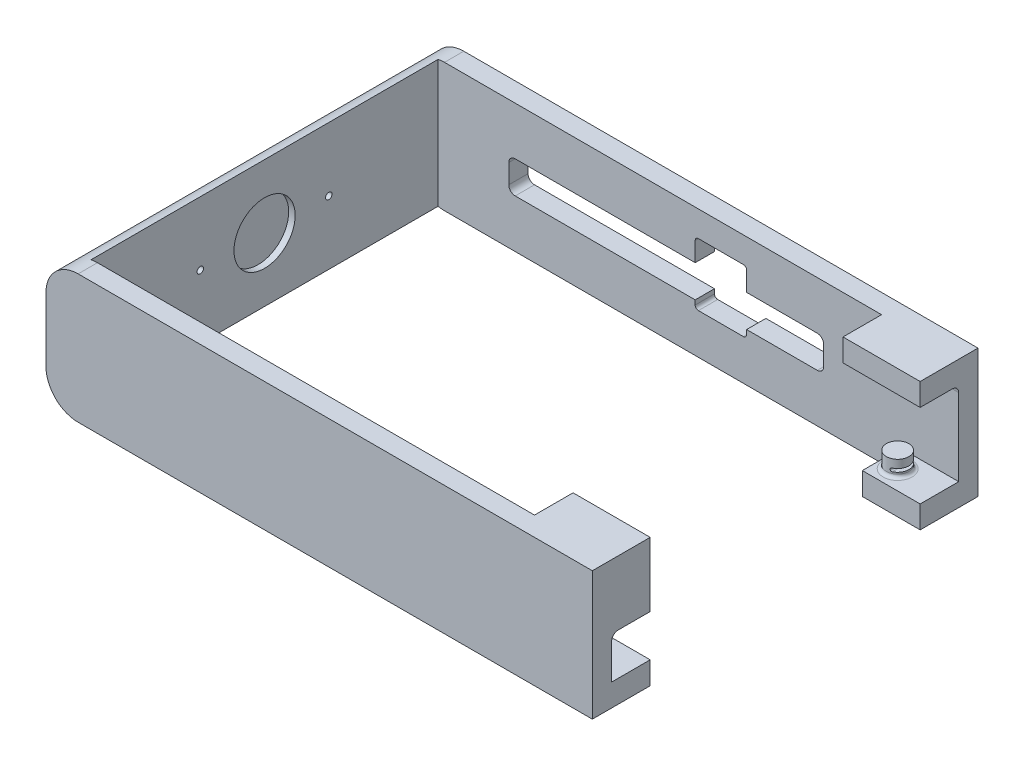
ISO-10303-21;
HEADER;
FILE_DESCRIPTION(('STEP AP214'),'2;1');
FILE_NAME('part.step','',(''),(''),'','','');
FILE_SCHEMA(('AUTOMOTIVE_DESIGN { 1 0 10303 214 1 1 1 1 }'));
ENDSEC;
DATA;
#1=APPLICATION_CONTEXT('core data for automotive mechanical design processes');
#2=APPLICATION_PROTOCOL_DEFINITION('international standard','automotive_design',2000,#1);
#3=PRODUCT_CONTEXT('',#1,'mechanical');
#4=PRODUCT('Part','Part','',(#3));
#5=PRODUCT_RELATED_PRODUCT_CATEGORY('part','',(#4));
#6=PRODUCT_DEFINITION_FORMATION('','',#4);
#7=PRODUCT_DEFINITION_CONTEXT('part definition',#1,'design');
#8=PRODUCT_DEFINITION('design','',#6,#7);
#9=PRODUCT_DEFINITION_SHAPE('','',#8);
#10=(LENGTH_UNIT() NAMED_UNIT(*) SI_UNIT(.MILLI.,.METRE.));
#11=(NAMED_UNIT(*) PLANE_ANGLE_UNIT() SI_UNIT($,.RADIAN.));
#12=(NAMED_UNIT(*) SI_UNIT($,.STERADIAN.) SOLID_ANGLE_UNIT());
#13=UNCERTAINTY_MEASURE_WITH_UNIT(LENGTH_MEASURE(1.E-05),#10,'distance_accuracy_value','');
#14=(GEOMETRIC_REPRESENTATION_CONTEXT(3) GLOBAL_UNCERTAINTY_ASSIGNED_CONTEXT((#13)) GLOBAL_UNIT_ASSIGNED_CONTEXT((#10,
#11,#12)) REPRESENTATION_CONTEXT('',''));
#15=CARTESIAN_POINT('',(0.,0.,0.));
#16=DIRECTION('',(0.,0.,1.));
#17=DIRECTION('',(1.,0.,0.));
#18=AXIS2_PLACEMENT_3D('',#15,#16,#17);
#19=CARTESIAN_POINT('',(21.5,7.49999999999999,60.001));
#20=DIRECTION('',(0.,-1.,0.));
#21=DIRECTION('',(1.,0.,0.));
#22=AXIS2_PLACEMENT_3D('',#19,#20,#21);
#23=PLANE('',#22);
#24=DIRECTION('',(-1.,0.,0.));
#25=VECTOR('',#24,1.);
#26=CARTESIAN_POINT('',(21.5,7.49999999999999,0.));
#27=LINE('',#26,#25);
#28=CARTESIAN_POINT('',(1.5,7.5,0.));
#29=VERTEX_POINT('',#28);
#30=CARTESIAN_POINT('',(-26.5,7.5,0.));
#31=VERTEX_POINT('',#30);
#32=EDGE_CURVE('E404',#29,#31,#27,.T.);
#33=ORIENTED_EDGE('',*,*,#32,.T.);
#34=DIRECTION('',(0.,0.,-1.));
#35=VECTOR('',#34,1.);
#36=CARTESIAN_POINT('',(-26.5,7.5,3.));
#37=LINE('',#36,#35);
#38=CARTESIAN_POINT('',(-26.5,7.5,3.));
#39=VERTEX_POINT('',#38);
#40=EDGE_CURVE('E383',#31,#39,#37,.F.);
#41=ORIENTED_EDGE('',*,*,#40,.T.);
#42=DIRECTION('',(-1.,0.,0.));
#43=VECTOR('',#42,1.);
#44=CARTESIAN_POINT('',(21.5,7.5,3.));
#45=LINE('',#44,#43);
#46=CARTESIAN_POINT('',(1.50000000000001,7.5,3.));
#47=VERTEX_POINT('',#46);
#48=EDGE_CURVE('E361',#47,#39,#45,.T.);
#49=ORIENTED_EDGE('',*,*,#48,.F.);
#50=DIRECTION('',(0.,0.,1.));
#51=VECTOR('',#50,1.);
#52=CARTESIAN_POINT('',(1.50000000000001,7.5,60.001));
#53=LINE('',#52,#51);
#54=EDGE_CURVE('E372',#29,#47,#53,.T.);
#55=ORIENTED_EDGE('',*,*,#54,.F.);
#56=EDGE_LOOP('',(#33,#41,#49,#55));
#57=FACE_BOUND('',#56,.T.);
#58=ADVANCED_FACE('F26',(#57),#23,.F.);
#59=CARTESIAN_POINT('',(21.5,12.5,60.001));
#60=DIRECTION('',(0.,1.,0.));
#61=DIRECTION('',(-1.,0.,0.));
#62=AXIS2_PLACEMENT_3D('',#59,#60,#61);
#63=PLANE('',#62);
#64=DIRECTION('',(1.,0.,0.));
#65=VECTOR('',#64,1.);
#66=CARTESIAN_POINT('',(21.5,12.5,3.));
#67=LINE('',#66,#65);
#68=CARTESIAN_POINT('',(-26.5,12.5,3.));
#69=VERTEX_POINT('',#68);
#70=CARTESIAN_POINT('',(1.50000000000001,12.5,3.));
#71=VERTEX_POINT('',#70);
#72=EDGE_CURVE('E389',#69,#71,#67,.T.);
#73=ORIENTED_EDGE('',*,*,#72,.F.);
#74=DIRECTION('',(0.,0.,-1.));
#75=VECTOR('',#74,1.);
#76=CARTESIAN_POINT('',(-26.5,12.5,0.));
#77=LINE('',#76,#75);
#78=CARTESIAN_POINT('',(-26.5,12.5,0.));
#79=VERTEX_POINT('',#78);
#80=EDGE_CURVE('E824',#69,#79,#77,.T.);
#81=ORIENTED_EDGE('',*,*,#80,.T.);
#82=DIRECTION('',(1.,0.,0.));
#83=VECTOR('',#82,1.);
#84=CARTESIAN_POINT('',(21.5,12.5,0.));
#85=LINE('',#84,#83);
#86=CARTESIAN_POINT('',(1.50000000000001,12.5,0.));
#87=VERTEX_POINT('',#86);
#88=EDGE_CURVE('E395',#79,#87,#85,.T.);
#89=ORIENTED_EDGE('',*,*,#88,.T.);
#90=DIRECTION('',(0.,0.,-1.));
#91=VECTOR('',#90,1.);
#92=CARTESIAN_POINT('',(1.50000000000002,12.5,60.001));
#93=LINE('',#92,#91);
#94=EDGE_CURVE('E666',#71,#87,#93,.T.);
#95=ORIENTED_EDGE('',*,*,#94,.F.);
#96=EDGE_LOOP('',(#73,#81,#89,#95));
#97=FACE_BOUND('',#96,.T.);
#98=ADVANCED_FACE('F705',(#97),#63,.F.);
#99=CARTESIAN_POINT('',(36.,5.,54.));
#100=DIRECTION('',(0.,-1.,0.));
#101=DIRECTION('',(0.,0.,-1.));
#102=AXIS2_PLACEMENT_3D('',#99,#100,#101);
#103=CYLINDRICAL_SURFACE('',#102,1.75);
#104=CARTESIAN_POINT('',(36.,4.,54.));
#105=DIRECTION('',(0.,-1.,0.));
#106=DIRECTION('',(0.,0.,-1.));
#107=AXIS2_PLACEMENT_3D('',#104,#105,#106);
#108=CIRCLE('',#107,1.75);
#109=CARTESIAN_POINT('',(36.,4.,52.25));
#110=VERTEX_POINT('',#109);
#111=EDGE_CURVE('E1061',#110,#110,#108,.F.);
#112=ORIENTED_EDGE('',*,*,#111,.T.);
#113=EDGE_LOOP('',(#112));
#114=FACE_BOUND('',#113,.T.);
#115=CARTESIAN_POINT('',(36.,6.,54.));
#116=DIRECTION('',(0.,-1.,0.));
#117=DIRECTION('',(0.,0.,-1.));
#118=AXIS2_PLACEMENT_3D('',#115,#116,#117);
#119=CIRCLE('',#118,1.75);
#120=CARTESIAN_POINT('',(36.,6.,52.25));
#121=VERTEX_POINT('',#120);
#122=EDGE_CURVE('E626',#121,#121,#119,.T.);
#123=ORIENTED_EDGE('',*,*,#122,.T.);
#124=EDGE_LOOP('',(#123));
#125=FACE_BOUND('',#124,.T.);
#126=CARTESIAN_POINT('',(36.75,4.75,52.4188611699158));
#127=CARTESIAN_POINT('',(36.7355820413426,4.75001086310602,52.4120125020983));
#128=CARTESIAN_POINT('',(36.7210468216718,4.74875228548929,52.4053689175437));
#129=CARTESIAN_POINT('',(36.6921444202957,4.7436542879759,52.3926175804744));
#130=CARTESIAN_POINT('',(36.6777778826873,4.73980704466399,52.3865115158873));
#131=CARTESIAN_POINT('',(36.6496700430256,4.72947515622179,52.3749885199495));
#132=CARTESIAN_POINT('',(36.6359305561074,4.72298333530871,52.3695735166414));
#133=CARTESIAN_POINT('',(36.6096630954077,4.70745529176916,52.359570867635));
#134=CARTESIAN_POINT('',(36.5971331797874,4.69842324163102,52.3549818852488));
#135=CARTESIAN_POINT('',(36.5745989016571,4.67872565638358,52.3469816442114));
#136=CARTESIAN_POINT('',(36.5644801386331,4.66821508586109,52.3435111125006));
#137=CARTESIAN_POINT('',(36.5461372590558,4.64544267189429,52.3373731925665));
#138=CARTESIAN_POINT('',(36.537913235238,4.6331807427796,52.3347058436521));
#139=CARTESIAN_POINT('',(36.5241449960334,4.60808220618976,52.3303230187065));
#140=CARTESIAN_POINT('',(36.5184672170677,4.59532714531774,52.3285591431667));
#141=CARTESIAN_POINT('',(36.5093010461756,4.56898106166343,52.3257432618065));
#142=CARTESIAN_POINT('',(36.5058119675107,4.55539030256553,52.3246910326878));
#143=CARTESIAN_POINT('',(36.5012241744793,4.52819681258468,52.32331281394));
#144=CARTESIAN_POINT('',(36.5000569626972,4.51460664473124,52.322966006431));
#145=CARTESIAN_POINT('',(36.4999471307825,4.4874165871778,52.3229332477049));
#146=CARTESIAN_POINT('',(36.5010043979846,4.47381669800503,52.3232472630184));
#147=CARTESIAN_POINT('',(36.50528663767,4.44711705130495,52.3245328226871));
#148=CARTESIAN_POINT('',(36.5084926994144,4.43401397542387,52.325498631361));
#149=CARTESIAN_POINT('',(36.5169399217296,4.40855094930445,52.3280871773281));
#150=CARTESIAN_POINT('',(36.5221810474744,4.39619098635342,52.3297099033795));
#151=CARTESIAN_POINT('',(36.5345569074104,4.37246777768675,52.3336293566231));
#152=CARTESIAN_POINT('',(36.5417041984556,4.36111183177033,52.3359305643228));
#153=CARTESIAN_POINT('',(36.5576267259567,4.33978234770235,52.3411984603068));
#154=CARTESIAN_POINT('',(36.5664020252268,4.3298088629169,52.3441651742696));
#155=CARTESIAN_POINT('',(36.585524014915,4.31124179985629,52.3508285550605));
#156=CARTESIAN_POINT('',(36.5959045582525,4.30268904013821,52.3545416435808));
#157=CARTESIAN_POINT('',(36.6177269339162,4.28744137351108,52.362609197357));
#158=CARTESIAN_POINT('',(36.6291691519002,4.28074714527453,52.3669638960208));
#159=CARTESIAN_POINT('',(36.6533724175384,4.26901704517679,52.3764907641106));
#160=CARTESIAN_POINT('',(36.6661709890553,4.26408354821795,52.3816933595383));
#161=CARTESIAN_POINT('',(36.6921698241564,4.25640349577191,52.3926423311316));
#162=CARTESIAN_POINT('',(36.7053698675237,4.25365576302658,52.3983884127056));
#163=CARTESIAN_POINT('',(36.7290757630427,4.25065268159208,52.4090619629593));
#164=CARTESIAN_POINT('',(36.7395679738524,4.2499963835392,52.4139094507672));
#165=CARTESIAN_POINT('',(36.75,4.25,52.4188611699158));
#166=B_SPLINE_CURVE_WITH_KNOTS('',3,(#126,#127,#128,#129,#130,#131,#132,#133,#134,#135,#136,
#137,#138,#139,#140,#141,#142,#143,#144,#145,#146,#147,#148,#149,#150,#151,#152,#153,#154,#155,
#156,#157,#158,#159,#160,#161,#162,#163,#164,#165),.UNSPECIFIED.,.F.,.F.,(4,2,2,2,2,2,2,2,2,2,2,
2,2,2,2,2,2,2,2,4),(0.,0.0478620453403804,0.0958693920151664,0.1440078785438,0.192067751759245,
0.236823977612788,0.281582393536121,0.323591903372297,0.365588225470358,0.406326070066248,
0.447061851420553,0.487443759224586,0.527824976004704,0.568479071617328,0.609134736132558,
0.65080868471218,0.692497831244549,0.736320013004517,0.780118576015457,0.814761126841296),.UNSPECIFIED.);
#167=CARTESIAN_POINT('',(36.75,4.75,52.4188611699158));
#168=VERTEX_POINT('',#167);
#169=CARTESIAN_POINT('',(36.75,4.25,52.4188611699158));
#170=VERTEX_POINT('',#169);
#171=EDGE_CURVE('E983',#168,#170,#166,.T.);
#172=ORIENTED_EDGE('',*,*,#171,.T.);
#173=CARTESIAN_POINT('',(36.,4.25,54.));
#174=DIRECTION('',(0.,1.,0.));
#175=DIRECTION('',(0.,0.,1.));
#176=AXIS2_PLACEMENT_3D('',#173,#174,#175);
#177=CIRCLE('',#176,1.75);
#178=CARTESIAN_POINT('',(36.75,4.25,55.5811388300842));
#179=VERTEX_POINT('',#178);
#180=EDGE_CURVE('E1026',#170,#179,#177,.F.);
#181=ORIENTED_EDGE('',*,*,#180,.T.);
#182=CARTESIAN_POINT('',(36.75,4.25,55.5811388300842));
#183=CARTESIAN_POINT('',(36.7355820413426,4.24998913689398,55.5879874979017));
#184=CARTESIAN_POINT('',(36.7210468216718,4.25124771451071,55.5946310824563));
#185=CARTESIAN_POINT('',(36.6921444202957,4.25634571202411,55.6073824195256));
#186=CARTESIAN_POINT('',(36.6777778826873,4.26019295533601,55.6134884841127));
#187=CARTESIAN_POINT('',(36.6496700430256,4.27052484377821,55.6250114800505));
#188=CARTESIAN_POINT('',(36.6359305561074,4.27701666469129,55.6304264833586));
#189=CARTESIAN_POINT('',(36.6096630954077,4.29254470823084,55.640429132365));
#190=CARTESIAN_POINT('',(36.5971331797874,4.30157675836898,55.6450181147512));
#191=CARTESIAN_POINT('',(36.5745989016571,4.32127434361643,55.6530183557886));
#192=CARTESIAN_POINT('',(36.5644801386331,4.33178491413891,55.6564888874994));
#193=CARTESIAN_POINT('',(36.5461372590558,4.35455732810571,55.6626268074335));
#194=CARTESIAN_POINT('',(36.537913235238,4.3668192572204,55.6652941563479));
#195=CARTESIAN_POINT('',(36.5241449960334,4.39191779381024,55.6696769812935));
#196=CARTESIAN_POINT('',(36.5184672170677,4.40467285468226,55.6714408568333));
#197=CARTESIAN_POINT('',(36.5093010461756,4.43101893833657,55.6742567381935));
#198=CARTESIAN_POINT('',(36.5058119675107,4.44460969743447,55.6753089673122));
#199=CARTESIAN_POINT('',(36.5012241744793,4.47180318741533,55.67668718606));
#200=CARTESIAN_POINT('',(36.5000569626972,4.48539335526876,55.677033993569));
#201=CARTESIAN_POINT('',(36.4999471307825,4.5125834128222,55.6770667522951));
#202=CARTESIAN_POINT('',(36.5010043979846,4.52618330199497,55.6767527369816));
#203=CARTESIAN_POINT('',(36.50528663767,4.55288294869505,55.6754671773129));
#204=CARTESIAN_POINT('',(36.5084926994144,4.56598602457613,55.674501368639));
#205=CARTESIAN_POINT('',(36.5169399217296,4.59144905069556,55.6719128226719));
#206=CARTESIAN_POINT('',(36.5221810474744,4.60380901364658,55.6702900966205));
#207=CARTESIAN_POINT('',(36.5345569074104,4.62753222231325,55.6663706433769));
#208=CARTESIAN_POINT('',(36.5417041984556,4.63888816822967,55.6640694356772));
#209=CARTESIAN_POINT('',(36.5576267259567,4.66021765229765,55.6588015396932));
#210=CARTESIAN_POINT('',(36.5664020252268,4.67019113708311,55.6558348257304));
#211=CARTESIAN_POINT('',(36.585524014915,4.68875820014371,55.6491714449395));
#212=CARTESIAN_POINT('',(36.5959045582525,4.69731095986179,55.6454583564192));
#213=CARTESIAN_POINT('',(36.6177269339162,4.71255862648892,55.637390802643));
#214=CARTESIAN_POINT('',(36.6291691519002,4.71925285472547,55.6330361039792));
#215=CARTESIAN_POINT('',(36.6533724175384,4.7309829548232,55.6235092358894));
#216=CARTESIAN_POINT('',(36.6661709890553,4.73591645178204,55.6183066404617));
#217=CARTESIAN_POINT('',(36.6921698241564,4.74359650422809,55.6073576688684));
#218=CARTESIAN_POINT('',(36.7053698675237,4.74634423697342,55.6016115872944));
#219=CARTESIAN_POINT('',(36.7290757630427,4.74934731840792,55.5909380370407));
#220=CARTESIAN_POINT('',(36.7395679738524,4.7500036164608,55.5860905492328));
#221=CARTESIAN_POINT('',(36.75,4.75,55.5811388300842));
#222=B_SPLINE_CURVE_WITH_KNOTS('',3,(#182,#183,#184,#185,#186,#187,#188,#189,#190,#191,#192,
#193,#194,#195,#196,#197,#198,#199,#200,#201,#202,#203,#204,#205,#206,#207,#208,#209,#210,#211,
#212,#213,#214,#215,#216,#217,#218,#219,#220,#221),.UNSPECIFIED.,.F.,.F.,(4,2,2,2,2,2,2,2,2,2,2,
2,2,2,2,2,2,2,2,4),(0.,0.0478620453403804,0.0958693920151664,0.14400787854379,0.192067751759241,
0.236823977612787,0.281582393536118,0.323591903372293,0.365588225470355,0.406326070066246,
0.447061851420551,0.487443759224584,0.527824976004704,0.568479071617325,0.609134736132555,
0.650808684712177,0.692497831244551,0.736320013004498,0.780118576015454,0.814761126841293),.UNSPECIFIED.);
#223=CARTESIAN_POINT('',(36.75,4.75,55.5811388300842));
#224=VERTEX_POINT('',#223);
#225=EDGE_CURVE('E975',#179,#224,#222,.T.);
#226=ORIENTED_EDGE('',*,*,#225,.T.);
#227=CARTESIAN_POINT('',(36.,4.75,54.));
#228=DIRECTION('',(0.,-1.,0.));
#229=DIRECTION('',(0.,0.,-1.));
#230=AXIS2_PLACEMENT_3D('',#227,#228,#229);
#231=CIRCLE('',#230,1.75);
#232=EDGE_CURVE('E990',#224,#168,#231,.F.);
#233=ORIENTED_EDGE('',*,*,#232,.T.);
#234=EDGE_LOOP('',(#172,#181,#226,#233));
#235=FACE_BOUND('',#234,.T.);
#236=ADVANCED_FACE('F712',(#114,#125,#235),#103,.T.);
#237=CARTESIAN_POINT('',(42.5,3.5,9.));
#238=DIRECTION('',(0.,-1.,0.));
#239=DIRECTION('',(0.,0.,-1.));
#240=AXIS2_PLACEMENT_3D('',#237,#238,#239);
#241=PLANE('',#240);
#242=CARTESIAN_POINT('',(36.,3.5,6.));
#243=DIRECTION('',(0.,-1.,0.));
#244=DIRECTION('',(0.,0.,-1.));
#245=AXIS2_PLACEMENT_3D('',#242,#243,#244);
#246=CIRCLE('',#245,2.25);
#247=CARTESIAN_POINT('',(36.,3.5,3.75));
#248=VERTEX_POINT('',#247);
#249=EDGE_CURVE('E1069',#248,#248,#246,.T.);
#250=ORIENTED_EDGE('',*,*,#249,.T.);
#251=EDGE_LOOP('',(#250));
#252=FACE_BOUND('',#251,.T.);
#253=DIRECTION('',(0.,0.,-1.));
#254=VECTOR('',#253,1.);
#255=CARTESIAN_POINT('',(42.5,3.5,3.));
#256=LINE('',#255,#254);
#257=CARTESIAN_POINT('',(42.5,3.5,9.));
#258=VERTEX_POINT('',#257);
#259=CARTESIAN_POINT('',(42.5,3.5,3.));
#260=VERTEX_POINT('',#259);
#261=EDGE_CURVE('E520',#258,#260,#256,.T.);
#262=ORIENTED_EDGE('',*,*,#261,.T.);
#263=DIRECTION('',(-1.,0.,0.));
#264=VECTOR('',#263,1.);
#265=CARTESIAN_POINT('',(42.5,3.5,3.));
#266=LINE('',#265,#264);
#267=CARTESIAN_POINT('',(32.5,3.5,3.));
#268=VERTEX_POINT('',#267);
#269=EDGE_CURVE('E518',#260,#268,#266,.T.);
#270=ORIENTED_EDGE('',*,*,#269,.T.);
#271=CARTESIAN_POINT('',(32.5,3.5,4.));
#272=DIRECTION('',(0.,-1.,0.));
#273=DIRECTION('',(0.,0.,-1.));
#274=AXIS2_PLACEMENT_3D('',#271,#272,#273);
#275=CIRCLE('',#274,1.);
#276=CARTESIAN_POINT('',(33.5,3.5,4.));
#277=VERTEX_POINT('',#276);
#278=EDGE_CURVE('E11',#268,#277,#275,.T.);
#279=ORIENTED_EDGE('',*,*,#278,.T.);
#280=DIRECTION('',(0.,0.,1.));
#281=VECTOR('',#280,1.);
#282=CARTESIAN_POINT('',(33.5,3.5,3.));
#283=LINE('',#282,#281);
#284=CARTESIAN_POINT('',(33.5,3.5,9.00000000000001));
#285=VERTEX_POINT('',#284);
#286=EDGE_CURVE('E516',#277,#285,#283,.T.);
#287=ORIENTED_EDGE('',*,*,#286,.T.);
#288=DIRECTION('',(1.,0.,0.));
#289=VECTOR('',#288,1.);
#290=CARTESIAN_POINT('',(42.5,3.5,9.));
#291=LINE('',#290,#289);
#292=EDGE_CURVE('E514',#285,#258,#291,.T.);
#293=ORIENTED_EDGE('',*,*,#292,.T.);
#294=EDGE_LOOP('',(#262,#270,#279,#287,#293));
#295=FACE_BOUND('',#294,.T.);
#296=ADVANCED_FACE('F898',(#252,#295),#241,.F.);
#297=CARTESIAN_POINT('',(-42.5,0.,3.));
#298=DIRECTION('',(0.,1.,0.));
#299=DIRECTION('',(0.,0.,1.));
#300=AXIS2_PLACEMENT_3D('',#297,#298,#299);
#301=PLANE('',#300);
#302=DIRECTION('',(1.,0.,0.));
#303=VECTOR('',#302,1.);
#304=CARTESIAN_POINT('',(-42.5,0.,60.));
#305=LINE('',#304,#303);
#306=CARTESIAN_POINT('',(-37.5,0.,60.));
#307=VERTEX_POINT('',#306);
#308=CARTESIAN_POINT('',(42.5,0.,60.));
#309=VERTEX_POINT('',#308);
#310=EDGE_CURVE('E796',#307,#309,#305,.T.);
#311=ORIENTED_EDGE('',*,*,#310,.F.);
#312=DIRECTION('',(0.,0.,-1.));
#313=VECTOR('',#312,1.);
#314=CARTESIAN_POINT('',(-37.5,0.,3.));
#315=LINE('',#314,#313);
#316=CARTESIAN_POINT('',(-37.5,0.,57.));
#317=VERTEX_POINT('',#316);
#318=EDGE_CURVE('E454',#307,#317,#315,.T.);
#319=ORIENTED_EDGE('',*,*,#318,.T.);
#320=DIRECTION('',(1.,0.,0.));
#321=VECTOR('',#320,1.);
#322=CARTESIAN_POINT('',(-42.5,0.,57.));
#323=LINE('',#322,#321);
#324=CARTESIAN_POINT('',(32.5,0.,57.));
#325=VERTEX_POINT('',#324);
#326=EDGE_CURVE('E432',#317,#325,#323,.T.);
#327=ORIENTED_EDGE('',*,*,#326,.T.);
#328=CARTESIAN_POINT('',(32.5,0.,56.));
#329=DIRECTION('',(0.,1.,0.));
#330=DIRECTION('',(0.,0.,1.));
#331=AXIS2_PLACEMENT_3D('',#328,#329,#330);
#332=CIRCLE('',#331,1.);
#333=CARTESIAN_POINT('',(33.5,0.,56.));
#334=VERTEX_POINT('',#333);
#335=EDGE_CURVE('E758',#325,#334,#332,.T.);
#336=ORIENTED_EDGE('',*,*,#335,.T.);
#337=DIRECTION('',(0.,0.,-1.));
#338=VECTOR('',#337,1.);
#339=CARTESIAN_POINT('',(33.5,0.,57.));
#340=LINE('',#339,#338);
#341=CARTESIAN_POINT('',(33.5,0.,51.));
#342=VERTEX_POINT('',#341);
#343=EDGE_CURVE('E415',#334,#342,#340,.T.);
#344=ORIENTED_EDGE('',*,*,#343,.T.);
#345=DIRECTION('',(1.,0.,0.));
#346=VECTOR('',#345,1.);
#347=CARTESIAN_POINT('',(42.5,0.,51.));
#348=LINE('',#347,#346);
#349=CARTESIAN_POINT('',(42.5,0.,51.));
#350=VERTEX_POINT('',#349);
#351=EDGE_CURVE('E397',#342,#350,#348,.T.);
#352=ORIENTED_EDGE('',*,*,#351,.T.);
#353=DIRECTION('',(0.,0.,-1.));
#354=VECTOR('',#353,1.);
#355=CARTESIAN_POINT('',(42.5,0.,60.));
#356=LINE('',#355,#354);
#357=EDGE_CURVE('E531',#309,#350,#356,.T.);
#358=ORIENTED_EDGE('',*,*,#357,.F.);
#359=EDGE_LOOP('',(#311,#319,#327,#336,#344,#352,#358));
#360=FACE_BOUND('',#359,.T.);
#361=ADVANCED_FACE('F794',(#360),#301,.F.);
#362=CARTESIAN_POINT('',(-42.5,20.,3.));
#363=DIRECTION('',(0.,-1.,0.));
#364=DIRECTION('',(1.,0.,0.));
#365=AXIS2_PLACEMENT_3D('',#362,#363,#364);
#366=PLANE('',#365);
#367=DIRECTION('',(-1.,0.,0.));
#368=VECTOR('',#367,1.);
#369=CARTESIAN_POINT('',(-42.5,20.,0.));
#370=LINE('',#369,#368);
#371=CARTESIAN_POINT('',(42.5,20.,0.));
#372=VERTEX_POINT('',#371);
#373=CARTESIAN_POINT('',(-37.5,20.,0.));
#374=VERTEX_POINT('',#373);
#375=EDGE_CURVE('E492',#372,#374,#370,.T.);
#376=ORIENTED_EDGE('',*,*,#375,.T.);
#377=DIRECTION('',(0.,0.,-1.));
#378=VECTOR('',#377,1.);
#379=CARTESIAN_POINT('',(-37.5,20.,3.));
#380=LINE('',#379,#378);
#381=CARTESIAN_POINT('',(-37.5,20.,3.));
#382=VERTEX_POINT('',#381);
#383=EDGE_CURVE('E485',#374,#382,#380,.F.);
#384=ORIENTED_EDGE('',*,*,#383,.T.);
#385=DIRECTION('',(-1.,0.,0.));
#386=VECTOR('',#385,1.);
#387=CARTESIAN_POINT('',(-42.5,20.,3.));
#388=LINE('',#387,#386);
#389=CARTESIAN_POINT('',(30.5,20.,3.));
#390=VERTEX_POINT('',#389);
#391=EDGE_CURVE('E458',#390,#382,#388,.T.);
#392=ORIENTED_EDGE('',*,*,#391,.F.);
#393=DIRECTION('',(0.,0.,1.));
#394=VECTOR('',#393,1.);
#395=CARTESIAN_POINT('',(30.5,20.,3.));
#396=LINE('',#395,#394);
#397=CARTESIAN_POINT('',(30.5,20.,9.));
#398=VERTEX_POINT('',#397);
#399=EDGE_CURVE('E600',#390,#398,#396,.T.);
#400=ORIENTED_EDGE('',*,*,#399,.T.);
#401=DIRECTION('',(1.,0.,0.));
#402=VECTOR('',#401,1.);
#403=CARTESIAN_POINT('',(42.5,20.,9.));
#404=LINE('',#403,#402);
#405=CARTESIAN_POINT('',(42.5,20.,9.));
#406=VERTEX_POINT('',#405);
#407=EDGE_CURVE('E579',#398,#406,#404,.T.);
#408=ORIENTED_EDGE('',*,*,#407,.T.);
#409=DIRECTION('',(0.,0.,-1.));
#410=VECTOR('',#409,1.);
#411=CARTESIAN_POINT('',(42.5,20.,3.));
#412=LINE('',#411,#410);
#413=EDGE_CURVE('E461',#406,#372,#412,.T.);
#414=ORIENTED_EDGE('',*,*,#413,.T.);
#415=EDGE_LOOP('',(#376,#384,#392,#400,#408,#414));
#416=FACE_BOUND('',#415,.T.);
#417=ADVANCED_FACE('F574',(#416),#366,.F.);
#418=CARTESIAN_POINT('',(-42.5,0.,3.));
#419=DIRECTION('',(0.,0.,1.));
#420=DIRECTION('',(1.,0.,0.));
#421=AXIS2_PLACEMENT_3D('',#418,#419,#420);
#422=PLANE('',#421);
#423=DIRECTION('',(-1.,0.,0.));
#424=VECTOR('',#423,1.);
#425=CARTESIAN_POINT('',(9.5,6.3,3.));
#426=LINE('',#425,#424);
#427=CARTESIAN_POINT('',(9.,6.3,3.));
#428=VERTEX_POINT('',#427);
#429=CARTESIAN_POINT('',(2.00000000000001,6.3,3.));
#430=VERTEX_POINT('',#429);
#431=EDGE_CURVE('E369',#428,#430,#426,.T.);
#432=ORIENTED_EDGE('',*,*,#431,.T.);
#433=CARTESIAN_POINT('',(2.00000000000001,6.8,3.));
#434=DIRECTION('',(0.,0.,1.));
#435=DIRECTION('',(1.,0.,0.));
#436=AXIS2_PLACEMENT_3D('',#433,#434,#435);
#437=CIRCLE('',#436,0.5);
#438=CARTESIAN_POINT('',(1.50000000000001,6.8,3.));
#439=VERTEX_POINT('',#438);
#440=EDGE_CURVE('E364',#430,#439,#437,.F.);
#441=ORIENTED_EDGE('',*,*,#440,.T.);
#442=DIRECTION('',(0.,1.,0.));
#443=VECTOR('',#442,1.);
#444=CARTESIAN_POINT('',(1.50000000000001,16.,3.));
#445=LINE('',#444,#443);
#446=EDGE_CURVE('E355',#439,#47,#445,.T.);
#447=ORIENTED_EDGE('',*,*,#446,.T.);
#448=ORIENTED_EDGE('',*,*,#48,.T.);
#449=CARTESIAN_POINT('',(-26.5,8.5,3.));
#450=DIRECTION('',(0.,0.,1.));
#451=DIRECTION('',(1.,0.,0.));
#452=AXIS2_PLACEMENT_3D('',#449,#450,#451);
#453=CIRCLE('',#452,1.);
#454=CARTESIAN_POINT('',(-27.5,8.5,3.));
#455=VERTEX_POINT('',#454);
#456=EDGE_CURVE('E773',#39,#455,#453,.F.);
#457=ORIENTED_EDGE('',*,*,#456,.T.);
#458=DIRECTION('',(0.,1.,0.));
#459=VECTOR('',#458,1.);
#460=CARTESIAN_POINT('',(-27.5,12.5,3.));
#461=LINE('',#460,#459);
#462=CARTESIAN_POINT('',(-27.5,11.5,3.));
#463=VERTEX_POINT('',#462);
#464=EDGE_CURVE('E385',#455,#463,#461,.T.);
#465=ORIENTED_EDGE('',*,*,#464,.T.);
#466=CARTESIAN_POINT('',(-26.5,11.5,3.));
#467=DIRECTION('',(0.,0.,1.));
#468=DIRECTION('',(1.,0.,0.));
#469=AXIS2_PLACEMENT_3D('',#466,#467,#468);
#470=CIRCLE('',#469,1.);
#471=EDGE_CURVE('E769',#463,#69,#470,.F.);
#472=ORIENTED_EDGE('',*,*,#471,.T.);
#473=ORIENTED_EDGE('',*,*,#72,.T.);
#474=DIRECTION('',(0.,1.,0.));
#475=VECTOR('',#474,1.);
#476=CARTESIAN_POINT('',(1.50000000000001,16.,3.));
#477=LINE('',#476,#475);
#478=CARTESIAN_POINT('',(1.50000000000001,15.5,3.));
#479=VERTEX_POINT('',#478);
#480=EDGE_CURVE('E659',#71,#479,#477,.T.);
#481=ORIENTED_EDGE('',*,*,#480,.T.);
#482=CARTESIAN_POINT('',(2.00000000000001,15.5,3.));
#483=DIRECTION('',(0.,0.,1.));
#484=DIRECTION('',(1.,0.,0.));
#485=AXIS2_PLACEMENT_3D('',#482,#483,#484);
#486=CIRCLE('',#485,0.5);
#487=CARTESIAN_POINT('',(2.00000000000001,16.,3.));
#488=VERTEX_POINT('',#487);
#489=EDGE_CURVE('E854',#479,#488,#486,.F.);
#490=ORIENTED_EDGE('',*,*,#489,.T.);
#491=DIRECTION('',(1.,0.,0.));
#492=VECTOR('',#491,1.);
#493=CARTESIAN_POINT('',(9.50000000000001,16.,3.));
#494=LINE('',#493,#492);
#495=CARTESIAN_POINT('',(9.00000000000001,16.,3.));
#496=VERTEX_POINT('',#495);
#497=EDGE_CURVE('E656',#488,#496,#494,.T.);
#498=ORIENTED_EDGE('',*,*,#497,.T.);
#499=CARTESIAN_POINT('',(9.00000000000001,15.5,3.));
#500=DIRECTION('',(0.,0.,1.));
#501=DIRECTION('',(1.,0.,0.));
#502=AXIS2_PLACEMENT_3D('',#499,#500,#501);
#503=CIRCLE('',#502,0.5);
#504=CARTESIAN_POINT('',(9.50000000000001,15.5,3.));
#505=VERTEX_POINT('',#504);
#506=EDGE_CURVE('E872',#496,#505,#503,.F.);
#507=ORIENTED_EDGE('',*,*,#506,.T.);
#508=DIRECTION('',(0.,-1.,0.));
#509=VECTOR('',#508,1.);
#510=CARTESIAN_POINT('',(9.50000000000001,16.,3.));
#511=LINE('',#510,#509);
#512=CARTESIAN_POINT('',(9.50000000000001,12.5,3.));
#513=VERTEX_POINT('',#512);
#514=EDGE_CURVE('E655',#505,#513,#511,.T.);
#515=ORIENTED_EDGE('',*,*,#514,.T.);
#516=CARTESIAN_POINT('',(20.5,12.5,3.));
#517=VERTEX_POINT('',#516);
#518=EDGE_CURVE('E410',#513,#517,#67,.T.);
#519=ORIENTED_EDGE('',*,*,#518,.T.);
#520=CARTESIAN_POINT('',(20.5,11.5,3.));
#521=DIRECTION('',(0.,0.,1.));
#522=DIRECTION('',(1.,0.,0.));
#523=AXIS2_PLACEMENT_3D('',#520,#521,#522);
#524=CIRCLE('',#523,1.);
#525=CARTESIAN_POINT('',(21.5,11.5,3.));
#526=VERTEX_POINT('',#525);
#527=EDGE_CURVE('E765',#517,#526,#524,.F.);
#528=ORIENTED_EDGE('',*,*,#527,.T.);
#529=DIRECTION('',(0.,-1.,0.));
#530=VECTOR('',#529,1.);
#531=CARTESIAN_POINT('',(21.5,12.5,3.));
#532=LINE('',#531,#530);
#533=CARTESIAN_POINT('',(21.5,8.49999999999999,3.));
#534=VERTEX_POINT('',#533);
#535=EDGE_CURVE('E407',#526,#534,#532,.T.);
#536=ORIENTED_EDGE('',*,*,#535,.T.);
#537=CARTESIAN_POINT('',(20.5,8.49999999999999,3.));
#538=DIRECTION('',(0.,0.,1.));
#539=DIRECTION('',(1.,0.,0.));
#540=AXIS2_PLACEMENT_3D('',#537,#538,#539);
#541=CIRCLE('',#540,1.);
#542=CARTESIAN_POINT('',(20.5,7.49999999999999,3.));
#543=VERTEX_POINT('',#542);
#544=EDGE_CURVE('E740',#534,#543,#541,.F.);
#545=ORIENTED_EDGE('',*,*,#544,.T.);
#546=CARTESIAN_POINT('',(9.50000000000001,7.5,3.));
#547=VERTEX_POINT('',#546);
#548=EDGE_CURVE('E384',#543,#547,#45,.T.);
#549=ORIENTED_EDGE('',*,*,#548,.T.);
#550=DIRECTION('',(0.,-1.,0.));
#551=VECTOR('',#550,1.);
#552=CARTESIAN_POINT('',(9.50000000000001,16.,3.));
#553=LINE('',#552,#551);
#554=CARTESIAN_POINT('',(9.5,6.8,3.));
#555=VERTEX_POINT('',#554);
#556=EDGE_CURVE('E368',#547,#555,#553,.T.);
#557=ORIENTED_EDGE('',*,*,#556,.T.);
#558=CARTESIAN_POINT('',(9.,6.8,3.));
#559=DIRECTION('',(0.,0.,1.));
#560=DIRECTION('',(1.,0.,0.));
#561=AXIS2_PLACEMENT_3D('',#558,#559,#560);
#562=CIRCLE('',#561,0.5);
#563=EDGE_CURVE('E881',#555,#428,#562,.F.);
#564=ORIENTED_EDGE('',*,*,#563,.T.);
#565=EDGE_LOOP('',(#432,#441,#447,#448,#457,#465,#472,#473,#481,#490,#498,#507,#515,#519,#528,
#536,#545,#549,#557,#564));
#566=FACE_BOUND('',#565,.T.);
#567=DIRECTION('',(0.,1.,0.));
#568=VECTOR('',#567,1.);
#569=CARTESIAN_POINT('',(42.5,20.,3.));
#570=LINE('',#569,#568);
#571=CARTESIAN_POINT('',(42.5,15.5,3.));
#572=VERTEX_POINT('',#571);
#573=EDGE_CURVE('E462',#260,#572,#570,.T.);
#574=ORIENTED_EDGE('',*,*,#573,.T.);
#575=DIRECTION('',(-1.,0.,0.));
#576=VECTOR('',#575,1.);
#577=CARTESIAN_POINT('',(30.5,15.5,3.));
#578=LINE('',#577,#576);
#579=CARTESIAN_POINT('',(30.5,15.5,3.));
#580=VERTEX_POINT('',#579);
#581=EDGE_CURVE('E810',#572,#580,#578,.T.);
#582=ORIENTED_EDGE('',*,*,#581,.T.);
#583=DIRECTION('',(0.,1.,0.));
#584=VECTOR('',#583,1.);
#585=CARTESIAN_POINT('',(30.5,16.5,3.));
#586=LINE('',#585,#584);
#587=EDGE_CURVE('E393',#580,#390,#586,.T.);
#588=ORIENTED_EDGE('',*,*,#587,.T.);
#589=ORIENTED_EDGE('',*,*,#391,.T.);
#590=CARTESIAN_POINT('',(-37.5,15.,3.));
#591=DIRECTION('',(0.,0.,1.));
#592=DIRECTION('',(1.,0.,0.));
#593=AXIS2_PLACEMENT_3D('',#590,#591,#592);
#594=CIRCLE('',#593,5.);
#595=CARTESIAN_POINT('',(-38.5,19.8989794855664,3.));
#596=VERTEX_POINT('',#595);
#597=EDGE_CURVE('E536',#382,#596,#594,.T.);
#598=ORIENTED_EDGE('',*,*,#597,.T.);
#599=DIRECTION('',(0.,1.,0.));
#600=VECTOR('',#599,1.);
#601=CARTESIAN_POINT('',(-38.5,20.,3.));
#602=LINE('',#601,#600);
#603=CARTESIAN_POINT('',(-38.5,0.10102051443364,3.));
#604=VERTEX_POINT('',#603);
#605=EDGE_CURVE('E493',#604,#596,#602,.T.);
#606=ORIENTED_EDGE('',*,*,#605,.F.);
#607=CARTESIAN_POINT('',(-37.5,5.,3.));
#608=DIRECTION('',(0.,0.,1.));
#609=DIRECTION('',(1.,0.,0.));
#610=AXIS2_PLACEMENT_3D('',#607,#608,#609);
#611=CIRCLE('',#610,5.);
#612=CARTESIAN_POINT('',(-37.5,0.,3.));
#613=VERTEX_POINT('',#612);
#614=EDGE_CURVE('E488',#604,#613,#611,.T.);
#615=ORIENTED_EDGE('',*,*,#614,.T.);
#616=DIRECTION('',(1.,0.,0.));
#617=VECTOR('',#616,1.);
#618=CARTESIAN_POINT('',(-42.5,0.,3.));
#619=LINE('',#618,#617);
#620=CARTESIAN_POINT('',(32.5,0.,3.));
#621=VERTEX_POINT('',#620);
#622=EDGE_CURVE('E489',#613,#621,#619,.T.);
#623=ORIENTED_EDGE('',*,*,#622,.T.);
#624=DIRECTION('',(0.,-1.,0.));
#625=VECTOR('',#624,1.);
#626=CARTESIAN_POINT('',(32.5,0.,3.));
#627=LINE('',#626,#625);
#628=EDGE_CURVE('E883',#621,#268,#627,.F.);
#629=ORIENTED_EDGE('',*,*,#628,.T.);
#630=ORIENTED_EDGE('',*,*,#269,.F.);
#631=EDGE_LOOP('',(#574,#582,#588,#589,#598,#606,#615,#623,#629,#630));
#632=FACE_BOUND('',#631,.T.);
#633=ADVANCED_FACE('F358',(#566,#632),#422,.T.);
#634=CARTESIAN_POINT('',(-42.5,20.,3.));
#635=DIRECTION('',(1.,0.,0.));
#636=DIRECTION('',(0.,1.,0.));
#637=AXIS2_PLACEMENT_3D('',#634,#635,#636);
#638=PLANE('',#637);
#639=CARTESIAN_POINT('',(-42.5,10.0000000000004,40.));
#640=DIRECTION('',(-1.,0.,0.));
#641=DIRECTION('',(0.,-1.,0.));
#642=AXIS2_PLACEMENT_3D('',#639,#640,#641);
#643=CIRCLE('',#642,0.499999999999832);
#644=CARTESIAN_POINT('',(-42.5,9.50000000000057,40.));
#645=VERTEX_POINT('',#644);
#646=EDGE_CURVE('E684',#645,#645,#643,.T.);
#647=ORIENTED_EDGE('',*,*,#646,.F.);
#648=EDGE_LOOP('',(#647));
#649=FACE_BOUND('',#648,.T.);
#650=CARTESIAN_POINT('',(-42.5,10.0000000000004,19.9999999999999));
#651=DIRECTION('',(-1.,0.,0.));
#652=DIRECTION('',(0.,-1.,0.));
#653=AXIS2_PLACEMENT_3D('',#650,#651,#652);
#654=CIRCLE('',#653,0.499999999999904);
#655=CARTESIAN_POINT('',(-42.5,9.50000000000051,19.9999999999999));
#656=VERTEX_POINT('',#655);
#657=EDGE_CURVE('E681',#656,#656,#654,.T.);
#658=ORIENTED_EDGE('',*,*,#657,.F.);
#659=EDGE_LOOP('',(#658));
#660=FACE_BOUND('',#659,.T.);
#661=DIRECTION('',(0.,-1.,0.));
#662=VECTOR('',#661,1.);
#663=CARTESIAN_POINT('',(-42.5,0.,60.));
#664=LINE('',#663,#662);
#665=CARTESIAN_POINT('',(-42.5,15.,60.));
#666=VERTEX_POINT('',#665);
#667=CARTESIAN_POINT('',(-42.5,5.,60.));
#668=VERTEX_POINT('',#667);
#669=EDGE_CURVE('E566',#666,#668,#664,.T.);
#670=ORIENTED_EDGE('',*,*,#669,.F.);
#671=DIRECTION('',(0.,0.,-1.));
#672=VECTOR('',#671,1.);
#673=CARTESIAN_POINT('',(-42.5,15.,3.));
#674=LINE('',#673,#672);
#675=CARTESIAN_POINT('',(-42.5,15.,0.));
#676=VERTEX_POINT('',#675);
#677=EDGE_CURVE('E476',#666,#676,#674,.T.);
#678=ORIENTED_EDGE('',*,*,#677,.T.);
#679=DIRECTION('',(0.,-1.,0.));
#680=VECTOR('',#679,1.);
#681=CARTESIAN_POINT('',(-42.5,20.,0.));
#682=LINE('',#681,#680);
#683=CARTESIAN_POINT('',(-42.5,5.,0.));
#684=VERTEX_POINT('',#683);
#685=EDGE_CURVE('E504',#676,#684,#682,.T.);
#686=ORIENTED_EDGE('',*,*,#685,.T.);
#687=DIRECTION('',(0.,0.,-1.));
#688=VECTOR('',#687,1.);
#689=CARTESIAN_POINT('',(-42.5,5.,3.));
#690=LINE('',#689,#688);
#691=EDGE_CURVE('E474',#684,#668,#690,.F.);
#692=ORIENTED_EDGE('',*,*,#691,.T.);
#693=EDGE_LOOP('',(#670,#678,#686,#692));
#694=FACE_BOUND('',#693,.T.);
#695=ADVANCED_FACE('F28',(#649,#660,#694),#638,.F.);
#696=ORIENTED_EDGE('',*,*,#622,.F.);
#697=DIRECTION('',(0.,0.,-1.));
#698=VECTOR('',#697,1.);
#699=CARTESIAN_POINT('',(-37.5,0.,3.));
#700=LINE('',#699,#698);
#701=CARTESIAN_POINT('',(-37.5,0.,0.));
#702=VERTEX_POINT('',#701);
#703=EDGE_CURVE('E452',#613,#702,#700,.T.);
#704=ORIENTED_EDGE('',*,*,#703,.T.);
#705=DIRECTION('',(1.,0.,0.));
#706=VECTOR('',#705,1.);
#707=CARTESIAN_POINT('',(-42.5,0.,0.));
#708=LINE('',#707,#706);
#709=CARTESIAN_POINT('',(42.5,0.,0.));
#710=VERTEX_POINT('',#709);
#711=EDGE_CURVE('E502',#702,#710,#708,.T.);
#712=ORIENTED_EDGE('',*,*,#711,.T.);
#713=DIRECTION('',(0.,0.,-1.));
#714=VECTOR('',#713,1.);
#715=CARTESIAN_POINT('',(42.5,0.,3.));
#716=LINE('',#715,#714);
#717=CARTESIAN_POINT('',(42.5,0.,9.00000000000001));
#718=VERTEX_POINT('',#717);
#719=EDGE_CURVE('E471',#718,#710,#716,.T.);
#720=ORIENTED_EDGE('',*,*,#719,.F.);
#721=DIRECTION('',(1.,0.,0.));
#722=VECTOR('',#721,1.);
#723=CARTESIAN_POINT('',(42.5,0.,9.00000000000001));
#724=LINE('',#723,#722);
#725=CARTESIAN_POINT('',(33.5,0.,9.));
#726=VERTEX_POINT('',#725);
#727=EDGE_CURVE('E523',#726,#718,#724,.T.);
#728=ORIENTED_EDGE('',*,*,#727,.F.);
#729=DIRECTION('',(0.,0.,1.));
#730=VECTOR('',#729,1.);
#731=CARTESIAN_POINT('',(33.5,0.,3.));
#732=LINE('',#731,#730);
#733=CARTESIAN_POINT('',(33.5,0.,4.));
#734=VERTEX_POINT('',#733);
#735=EDGE_CURVE('E526',#734,#726,#732,.T.);
#736=ORIENTED_EDGE('',*,*,#735,.F.);
#737=CARTESIAN_POINT('',(32.5,0.,4.));
#738=DIRECTION('',(0.,1.,0.));
#739=DIRECTION('',(0.,0.,1.));
#740=AXIS2_PLACEMENT_3D('',#737,#738,#739);
#741=CIRCLE('',#740,1.);
#742=EDGE_CURVE('E35',#734,#621,#741,.T.);
#743=ORIENTED_EDGE('',*,*,#742,.T.);
#744=EDGE_LOOP('',(#696,#704,#712,#720,#728,#736,#743));
#745=FACE_BOUND('',#744,.T.);
#746=ADVANCED_FACE('F551',(#745),#301,.F.);
#747=CARTESIAN_POINT('',(42.5,20.,3.));
#748=DIRECTION('',(-1.,0.,0.));
#749=DIRECTION('',(0.,0.,1.));
#750=AXIS2_PLACEMENT_3D('',#747,#748,#749);
#751=PLANE('',#750);
#752=DIRECTION('',(0.,1.,0.));
#753=VECTOR('',#752,1.);
#754=CARTESIAN_POINT('',(42.5,20.,0.));
#755=LINE('',#754,#753);
#756=EDGE_CURVE('E500',#710,#372,#755,.T.);
#757=ORIENTED_EDGE('',*,*,#756,.T.);
#758=ORIENTED_EDGE('',*,*,#413,.F.);
#759=DIRECTION('',(0.,1.,0.));
#760=VECTOR('',#759,1.);
#761=CARTESIAN_POINT('',(42.5,16.5,9.));
#762=LINE('',#761,#760);
#763=CARTESIAN_POINT('',(42.5,16.5,9.));
#764=VERTEX_POINT('',#763);
#765=EDGE_CURVE('E411',#764,#406,#762,.T.);
#766=ORIENTED_EDGE('',*,*,#765,.F.);
#767=DIRECTION('',(0.,0.,-1.));
#768=VECTOR('',#767,1.);
#769=CARTESIAN_POINT('',(42.5,16.5,3.));
#770=LINE('',#769,#768);
#771=CARTESIAN_POINT('',(42.5,16.5,4.));
#772=VERTEX_POINT('',#771);
#773=EDGE_CURVE('E597',#764,#772,#770,.T.);
#774=ORIENTED_EDGE('',*,*,#773,.T.);
#775=CARTESIAN_POINT('',(42.5,15.5,4.));
#776=DIRECTION('',(-1.,0.,0.));
#777=DIRECTION('',(0.,0.,1.));
#778=AXIS2_PLACEMENT_3D('',#775,#776,#777);
#779=CIRCLE('',#778,1.);
#780=EDGE_CURVE('E751',#772,#572,#779,.T.);
#781=ORIENTED_EDGE('',*,*,#780,.T.);
#782=ORIENTED_EDGE('',*,*,#573,.F.);
#783=ORIENTED_EDGE('',*,*,#261,.F.);
#784=DIRECTION('',(0.,-1.,0.));
#785=VECTOR('',#784,1.);
#786=CARTESIAN_POINT('',(42.5,3.5,9.));
#787=LINE('',#786,#785);
#788=EDGE_CURVE('E511',#258,#718,#787,.T.);
#789=ORIENTED_EDGE('',*,*,#788,.T.);
#790=ORIENTED_EDGE('',*,*,#719,.T.);
#791=EDGE_LOOP('',(#757,#758,#766,#774,#781,#782,#783,#789,#790));
#792=FACE_BOUND('',#791,.T.);
#793=ADVANCED_FACE('F582',(#792),#751,.F.);
#794=DIRECTION('',(0.,0.,-1.));
#795=VECTOR('',#794,1.);
#796=CARTESIAN_POINT('',(42.5,20.,60.));
#797=LINE('',#796,#795);
#798=CARTESIAN_POINT('',(42.5,20.,60.));
#799=VERTEX_POINT('',#798);
#800=CARTESIAN_POINT('',(42.5,20.,51.));
#801=VERTEX_POINT('',#800);
#802=EDGE_CURVE('E1306',#799,#801,#797,.T.);
#803=ORIENTED_EDGE('',*,*,#802,.T.);
#804=DIRECTION('',(-1.,0.,0.));
#805=VECTOR('',#804,1.);
#806=CARTESIAN_POINT('',(42.5,20.,51.));
#807=LINE('',#806,#805);
#808=CARTESIAN_POINT('',(30.5,20.,51.));
#809=VERTEX_POINT('',#808);
#810=EDGE_CURVE('E620',#801,#809,#807,.T.);
#811=ORIENTED_EDGE('',*,*,#810,.T.);
#812=DIRECTION('',(0.,0.,1.));
#813=VECTOR('',#812,1.);
#814=CARTESIAN_POINT('',(30.5,20.,57.));
#815=LINE('',#814,#813);
#816=CARTESIAN_POINT('',(30.5,20.,57.));
#817=VERTEX_POINT('',#816);
#818=EDGE_CURVE('E618',#809,#817,#815,.T.);
#819=ORIENTED_EDGE('',*,*,#818,.T.);
#820=DIRECTION('',(-1.,0.,0.));
#821=VECTOR('',#820,1.);
#822=CARTESIAN_POINT('',(-42.5,20.,57.));
#823=LINE('',#822,#821);
#824=CARTESIAN_POINT('',(-37.5,20.,57.));
#825=VERTEX_POINT('',#824);
#826=EDGE_CURVE('E463',#817,#825,#823,.T.);
#827=ORIENTED_EDGE('',*,*,#826,.T.);
#828=DIRECTION('',(0.,0.,-1.));
#829=VECTOR('',#828,1.);
#830=CARTESIAN_POINT('',(-37.5,20.,3.));
#831=LINE('',#830,#829);
#832=CARTESIAN_POINT('',(-37.5,20.,60.));
#833=VERTEX_POINT('',#832);
#834=EDGE_CURVE('E483',#825,#833,#831,.F.);
#835=ORIENTED_EDGE('',*,*,#834,.T.);
#836=DIRECTION('',(-1.,0.,0.));
#837=VECTOR('',#836,1.);
#838=CARTESIAN_POINT('',(-42.5,20.,60.));
#839=LINE('',#838,#837);
#840=EDGE_CURVE('E1308',#799,#833,#839,.T.);
#841=ORIENTED_EDGE('',*,*,#840,.F.);
#842=EDGE_LOOP('',(#803,#811,#819,#827,#835,#841));
#843=FACE_BOUND('',#842,.T.);
#844=ADVANCED_FACE('F1138',(#843),#366,.F.);
#845=CARTESIAN_POINT('',(-42.5,0.,0.));
#846=DIRECTION('',(0.,0.,1.));
#847=DIRECTION('',(1.,0.,0.));
#848=AXIS2_PLACEMENT_3D('',#845,#846,#847);
#849=PLANE('',#848);
#850=ORIENTED_EDGE('',*,*,#32,.F.);
#851=DIRECTION('',(0.,1.,0.));
#852=VECTOR('',#851,1.);
#853=CARTESIAN_POINT('',(1.50000000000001,16.,0.));
#854=LINE('',#853,#852);
#855=CARTESIAN_POINT('',(1.50000000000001,6.8,0.));
#856=VERTEX_POINT('',#855);
#857=EDGE_CURVE('E375',#856,#29,#854,.T.);
#858=ORIENTED_EDGE('',*,*,#857,.F.);
#859=CARTESIAN_POINT('',(2.00000000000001,6.8,0.));
#860=DIRECTION('',(0.,0.,1.));
#861=DIRECTION('',(1.,0.,0.));
#862=AXIS2_PLACEMENT_3D('',#859,#860,#861);
#863=CIRCLE('',#862,0.5);
#864=CARTESIAN_POINT('',(2.00000000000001,6.3,0.));
#865=VERTEX_POINT('',#864);
#866=EDGE_CURVE('E876',#856,#865,#863,.T.);
#867=ORIENTED_EDGE('',*,*,#866,.T.);
#868=DIRECTION('',(-1.,0.,0.));
#869=VECTOR('',#868,1.);
#870=CARTESIAN_POINT('',(9.5,6.3,0.));
#871=LINE('',#870,#869);
#872=CARTESIAN_POINT('',(9.,6.3,0.));
#873=VERTEX_POINT('',#872);
#874=EDGE_CURVE('E673',#873,#865,#871,.T.);
#875=ORIENTED_EDGE('',*,*,#874,.F.);
#876=CARTESIAN_POINT('',(9.,6.8,0.));
#877=DIRECTION('',(0.,0.,1.));
#878=DIRECTION('',(1.,0.,0.));
#879=AXIS2_PLACEMENT_3D('',#876,#877,#878);
#880=CIRCLE('',#879,0.5);
#881=CARTESIAN_POINT('',(9.5,6.8,0.));
#882=VERTEX_POINT('',#881);
#883=EDGE_CURVE('E879',#873,#882,#880,.T.);
#884=ORIENTED_EDGE('',*,*,#883,.T.);
#885=DIRECTION('',(0.,-1.,0.));
#886=VECTOR('',#885,1.);
#887=CARTESIAN_POINT('',(9.50000000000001,16.,0.));
#888=LINE('',#887,#886);
#889=CARTESIAN_POINT('',(9.50000000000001,7.5,0.));
#890=VERTEX_POINT('',#889);
#891=EDGE_CURVE('E379',#890,#882,#888,.T.);
#892=ORIENTED_EDGE('',*,*,#891,.F.);
#893=CARTESIAN_POINT('',(20.5,7.49999999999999,0.));
#894=VERTEX_POINT('',#893);
#895=EDGE_CURVE('E402',#894,#890,#27,.T.);
#896=ORIENTED_EDGE('',*,*,#895,.F.);
#897=CARTESIAN_POINT('',(20.5,8.49999999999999,0.));
#898=DIRECTION('',(0.,0.,1.));
#899=DIRECTION('',(1.,0.,0.));
#900=AXIS2_PLACEMENT_3D('',#897,#898,#899);
#901=CIRCLE('',#900,1.);
#902=CARTESIAN_POINT('',(21.5,8.49999999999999,0.));
#903=VERTEX_POINT('',#902);
#904=EDGE_CURVE('E741',#894,#903,#901,.T.);
#905=ORIENTED_EDGE('',*,*,#904,.T.);
#906=DIRECTION('',(0.,-1.,0.));
#907=VECTOR('',#906,1.);
#908=CARTESIAN_POINT('',(21.5,12.5,0.));
#909=LINE('',#908,#907);
#910=CARTESIAN_POINT('',(21.5,11.5,0.));
#911=VERTEX_POINT('',#910);
#912=EDGE_CURVE('E387',#911,#903,#909,.T.);
#913=ORIENTED_EDGE('',*,*,#912,.F.);
#914=CARTESIAN_POINT('',(20.5,11.5,0.));
#915=DIRECTION('',(0.,0.,1.));
#916=DIRECTION('',(1.,0.,0.));
#917=AXIS2_PLACEMENT_3D('',#914,#915,#916);
#918=CIRCLE('',#917,1.);
#919=CARTESIAN_POINT('',(20.5,12.5,0.));
#920=VERTEX_POINT('',#919);
#921=EDGE_CURVE('E763',#911,#920,#918,.T.);
#922=ORIENTED_EDGE('',*,*,#921,.T.);
#923=CARTESIAN_POINT('',(9.50000000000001,12.5,0.));
#924=VERTEX_POINT('',#923);
#925=EDGE_CURVE('E398',#924,#920,#85,.T.);
#926=ORIENTED_EDGE('',*,*,#925,.F.);
#927=DIRECTION('',(0.,-1.,0.));
#928=VECTOR('',#927,1.);
#929=CARTESIAN_POINT('',(9.50000000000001,16.,0.));
#930=LINE('',#929,#928);
#931=CARTESIAN_POINT('',(9.50000000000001,15.5,0.));
#932=VERTEX_POINT('',#931);
#933=EDGE_CURVE('E653',#932,#924,#930,.T.);
#934=ORIENTED_EDGE('',*,*,#933,.F.);
#935=CARTESIAN_POINT('',(9.00000000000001,15.5,0.));
#936=DIRECTION('',(0.,0.,1.));
#937=DIRECTION('',(1.,0.,0.));
#938=AXIS2_PLACEMENT_3D('',#935,#936,#937);
#939=CIRCLE('',#938,0.5);
#940=CARTESIAN_POINT('',(9.00000000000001,16.,0.));
#941=VERTEX_POINT('',#940);
#942=EDGE_CURVE('E870',#932,#941,#939,.T.);
#943=ORIENTED_EDGE('',*,*,#942,.T.);
#944=DIRECTION('',(1.,0.,0.));
#945=VECTOR('',#944,1.);
#946=CARTESIAN_POINT('',(9.50000000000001,16.,0.));
#947=LINE('',#946,#945);
#948=CARTESIAN_POINT('',(2.00000000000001,16.,0.));
#949=VERTEX_POINT('',#948);
#950=EDGE_CURVE('E645',#949,#941,#947,.T.);
#951=ORIENTED_EDGE('',*,*,#950,.F.);
#952=CARTESIAN_POINT('',(2.00000000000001,15.5,0.));
#953=DIRECTION('',(0.,0.,1.));
#954=DIRECTION('',(1.,0.,0.));
#955=AXIS2_PLACEMENT_3D('',#952,#953,#954);
#956=CIRCLE('',#955,0.5);
#957=CARTESIAN_POINT('',(1.50000000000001,15.5,0.));
#958=VERTEX_POINT('',#957);
#959=EDGE_CURVE('E843',#949,#958,#956,.T.);
#960=ORIENTED_EDGE('',*,*,#959,.T.);
#961=DIRECTION('',(0.,1.,0.));
#962=VECTOR('',#961,1.);
#963=CARTESIAN_POINT('',(1.50000000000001,16.,0.));
#964=LINE('',#963,#962);
#965=EDGE_CURVE('E650',#87,#958,#964,.T.);
#966=ORIENTED_EDGE('',*,*,#965,.F.);
#967=ORIENTED_EDGE('',*,*,#88,.F.);
#968=CARTESIAN_POINT('',(-26.5,11.5,0.));
#969=DIRECTION('',(0.,0.,1.));
#970=DIRECTION('',(1.,0.,0.));
#971=AXIS2_PLACEMENT_3D('',#968,#969,#970);
#972=CIRCLE('',#971,1.);
#973=CARTESIAN_POINT('',(-27.5,11.5,0.));
#974=VERTEX_POINT('',#973);
#975=EDGE_CURVE('E767',#79,#974,#972,.T.);
#976=ORIENTED_EDGE('',*,*,#975,.T.);
#977=DIRECTION('',(0.,1.,0.));
#978=VECTOR('',#977,1.);
#979=CARTESIAN_POINT('',(-27.5,12.5,0.));
#980=LINE('',#979,#978);
#981=CARTESIAN_POINT('',(-27.5,8.5,0.));
#982=VERTEX_POINT('',#981);
#983=EDGE_CURVE('E399',#982,#974,#980,.T.);
#984=ORIENTED_EDGE('',*,*,#983,.F.);
#985=CARTESIAN_POINT('',(-26.5,8.5,0.));
#986=DIRECTION('',(0.,0.,1.));
#987=DIRECTION('',(1.,0.,0.));
#988=AXIS2_PLACEMENT_3D('',#985,#986,#987);
#989=CIRCLE('',#988,1.);
#990=EDGE_CURVE('E771',#982,#31,#989,.T.);
#991=ORIENTED_EDGE('',*,*,#990,.T.);
#992=EDGE_LOOP('',(#850,#858,#867,#875,#884,#892,#896,#905,#913,#922,#926,#934,#943,#951,#960,
#966,#967,#976,#984,#991));
#993=FACE_BOUND('',#992,.T.);
#994=ORIENTED_EDGE('',*,*,#685,.F.);
#995=CARTESIAN_POINT('',(-37.5,15.,0.));
#996=DIRECTION('',(0.,0.,1.));
#997=DIRECTION('',(1.,0.,0.));
#998=AXIS2_PLACEMENT_3D('',#995,#996,#997);
#999=CIRCLE('',#998,5.);
#1000=EDGE_CURVE('E481',#676,#374,#999,.F.);
#1001=ORIENTED_EDGE('',*,*,#1000,.T.);
#1002=ORIENTED_EDGE('',*,*,#375,.F.);
#1003=ORIENTED_EDGE('',*,*,#756,.F.);
#1004=ORIENTED_EDGE('',*,*,#711,.F.);
#1005=CARTESIAN_POINT('',(-37.5,5.,0.));
#1006=DIRECTION('',(0.,0.,1.));
#1007=DIRECTION('',(1.,0.,0.));
#1008=AXIS2_PLACEMENT_3D('',#1005,#1006,#1007);
#1009=CIRCLE('',#1008,5.);
#1010=EDGE_CURVE('E479',#702,#684,#1009,.F.);
#1011=ORIENTED_EDGE('',*,*,#1010,.T.);
#1012=EDGE_LOOP('',(#994,#1001,#1002,#1003,#1004,#1011));
#1013=FACE_BOUND('',#1012,.T.);
#1014=ADVANCED_FACE('F560',(#993,#1013),#849,.F.);
#1015=CARTESIAN_POINT('',(-38.5,20.,30.));
#1016=DIRECTION('',(-1.,0.,0.));
#1017=DIRECTION('',(0.,0.,1.));
#1018=AXIS2_PLACEMENT_3D('',#1015,#1016,#1017);
#1019=PLANE('',#1018);
#1020=CARTESIAN_POINT('',(-38.5,10.0000000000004,40.));
#1021=DIRECTION('',(-1.,0.,0.));
#1022=DIRECTION('',(0.,0.,1.));
#1023=AXIS2_PLACEMENT_3D('',#1020,#1021,#1022);
#1024=CIRCLE('',#1023,0.499999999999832);
#1025=CARTESIAN_POINT('',(-38.5,10.0000000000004,40.4999999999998));
#1026=VERTEX_POINT('',#1025);
#1027=EDGE_CURVE('E30',#1026,#1026,#1024,.T.);
#1028=ORIENTED_EDGE('',*,*,#1027,.T.);
#1029=EDGE_LOOP('',(#1028));
#1030=FACE_BOUND('',#1029,.T.);
#1031=CARTESIAN_POINT('',(-38.5,10.0000000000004,19.9999999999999));
#1032=DIRECTION('',(-1.,0.,0.));
#1033=DIRECTION('',(0.,0.,1.));
#1034=AXIS2_PLACEMENT_3D('',#1031,#1032,#1033);
#1035=CIRCLE('',#1034,0.499999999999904);
#1036=CARTESIAN_POINT('',(-38.5,10.0000000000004,20.4999999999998));
#1037=VERTEX_POINT('',#1036);
#1038=EDGE_CURVE('E677',#1037,#1037,#1035,.T.);
#1039=ORIENTED_EDGE('',*,*,#1038,.T.);
#1040=EDGE_LOOP('',(#1039));
#1041=FACE_BOUND('',#1040,.T.);
#1042=CARTESIAN_POINT('',(-38.5,10.,30.));
#1043=DIRECTION('',(1.,0.,0.));
#1044=DIRECTION('',(0.,0.,-1.));
#1045=AXIS2_PLACEMENT_3D('',#1042,#1043,#1044);
#1046=CIRCLE('',#1045,4.7625);
#1047=CARTESIAN_POINT('',(-38.5,10.,25.2375));
#1048=VERTEX_POINT('',#1047);
#1049=EDGE_CURVE('E632',#1048,#1048,#1046,.T.);
#1050=ORIENTED_EDGE('',*,*,#1049,.F.);
#1051=EDGE_LOOP('',(#1050));
#1052=FACE_BOUND('',#1051,.T.);
#1053=ORIENTED_EDGE('',*,*,#605,.T.);
#1054=DIRECTION('',(0.,0.,-1.));
#1055=VECTOR('',#1054,1.);
#1056=CARTESIAN_POINT('',(-38.5,19.8989794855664,3.));
#1057=LINE('',#1056,#1055);
#1058=CARTESIAN_POINT('',(-38.5,19.8989794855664,57.));
#1059=VERTEX_POINT('',#1058);
#1060=EDGE_CURVE('E441',#596,#1059,#1057,.F.);
#1061=ORIENTED_EDGE('',*,*,#1060,.T.);
#1062=DIRECTION('',(0.,1.,0.));
#1063=VECTOR('',#1062,1.);
#1064=CARTESIAN_POINT('',(-38.5,20.,57.));
#1065=LINE('',#1064,#1063);
#1066=CARTESIAN_POINT('',(-38.5,0.101020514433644,57.));
#1067=VERTEX_POINT('',#1066);
#1068=EDGE_CURVE('E528',#1067,#1059,#1065,.T.);
#1069=ORIENTED_EDGE('',*,*,#1068,.F.);
#1070=DIRECTION('',(0.,0.,-1.));
#1071=VECTOR('',#1070,1.);
#1072=CARTESIAN_POINT('',(-38.5,0.101020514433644,57.));
#1073=LINE('',#1072,#1071);
#1074=EDGE_CURVE('E537',#1067,#604,#1073,.T.);
#1075=ORIENTED_EDGE('',*,*,#1074,.T.);
#1076=EDGE_LOOP('',(#1053,#1061,#1069,#1075));
#1077=FACE_BOUND('',#1076,.T.);
#1078=ADVANCED_FACE('F691',(#1030,#1041,#1052,#1077),#1019,.F.);
#1079=CARTESIAN_POINT('',(33.5,3.5,3.));
#1080=DIRECTION('',(1.,0.,0.));
#1081=DIRECTION('',(0.,0.,-1.));
#1082=AXIS2_PLACEMENT_3D('',#1079,#1080,#1081);
#1083=PLANE('',#1082);
#1084=ORIENTED_EDGE('',*,*,#286,.F.);
#1085=DIRECTION('',(0.,-1.,0.));
#1086=VECTOR('',#1085,1.);
#1087=CARTESIAN_POINT('',(33.5,3.5,4.));
#1088=LINE('',#1087,#1086);
#1089=EDGE_CURVE('E742',#277,#734,#1088,.T.);
#1090=ORIENTED_EDGE('',*,*,#1089,.T.);
#1091=ORIENTED_EDGE('',*,*,#735,.T.);
#1092=DIRECTION('',(0.,-1.,0.));
#1093=VECTOR('',#1092,1.);
#1094=CARTESIAN_POINT('',(33.5,3.5,9.00000000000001));
#1095=LINE('',#1094,#1093);
#1096=EDGE_CURVE('E508',#285,#726,#1095,.T.);
#1097=ORIENTED_EDGE('',*,*,#1096,.F.);
#1098=EDGE_LOOP('',(#1084,#1090,#1091,#1097));
#1099=FACE_BOUND('',#1098,.T.);
#1100=ADVANCED_FACE('F782',(#1099),#1083,.F.);
#1101=CARTESIAN_POINT('',(42.5,3.5,9.));
#1102=DIRECTION('',(0.,0.,-1.));
#1103=DIRECTION('',(-1.,0.,0.));
#1104=AXIS2_PLACEMENT_3D('',#1101,#1102,#1103);
#1105=PLANE('',#1104);
#1106=ORIENTED_EDGE('',*,*,#727,.T.);
#1107=ORIENTED_EDGE('',*,*,#788,.F.);
#1108=ORIENTED_EDGE('',*,*,#292,.F.);
#1109=ORIENTED_EDGE('',*,*,#1096,.T.);
#1110=EDGE_LOOP('',(#1106,#1107,#1108,#1109));
#1111=FACE_BOUND('',#1110,.T.);
#1112=ADVANCED_FACE('F903',(#1111),#1105,.F.);
#1113=CARTESIAN_POINT('',(42.5,0.,60.));
#1114=DIRECTION('',(-1.,0.,0.));
#1115=DIRECTION('',(0.,0.,1.));
#1116=AXIS2_PLACEMENT_3D('',#1113,#1114,#1115);
#1117=PLANE('',#1116);
#1118=ORIENTED_EDGE('',*,*,#357,.T.);
#1119=DIRECTION('',(0.,-1.,0.));
#1120=VECTOR('',#1119,1.);
#1121=CARTESIAN_POINT('',(42.5,3.5,51.));
#1122=LINE('',#1121,#1120);
#1123=CARTESIAN_POINT('',(42.5,3.5,51.));
#1124=VERTEX_POINT('',#1123);
#1125=EDGE_CURVE('E429',#1124,#350,#1122,.T.);
#1126=ORIENTED_EDGE('',*,*,#1125,.F.);
#1127=DIRECTION('',(0.,0.,1.));
#1128=VECTOR('',#1127,1.);
#1129=CARTESIAN_POINT('',(42.5,3.5,57.));
#1130=LINE('',#1129,#1128);
#1131=CARTESIAN_POINT('',(42.5,3.5,57.));
#1132=VERTEX_POINT('',#1131);
#1133=EDGE_CURVE('E417',#1124,#1132,#1130,.T.);
#1134=ORIENTED_EDGE('',*,*,#1133,.T.);
#1135=DIRECTION('',(0.,1.,0.));
#1136=VECTOR('',#1135,1.);
#1137=CARTESIAN_POINT('',(42.5,0.,57.));
#1138=LINE('',#1137,#1136);
#1139=CARTESIAN_POINT('',(42.5,9.,57.));
#1140=VERTEX_POINT('',#1139);
#1141=EDGE_CURVE('E435',#1132,#1140,#1138,.T.);
#1142=ORIENTED_EDGE('',*,*,#1141,.T.);
#1143=CARTESIAN_POINT('',(42.5,9.,56.));
#1144=DIRECTION('',(-1.,0.,0.));
#1145=DIRECTION('',(0.,0.,1.));
#1146=AXIS2_PLACEMENT_3D('',#1143,#1144,#1145);
#1147=CIRCLE('',#1146,1.);
#1148=CARTESIAN_POINT('',(42.5,10.,56.));
#1149=VERTEX_POINT('',#1148);
#1150=EDGE_CURVE('E753',#1140,#1149,#1147,.T.);
#1151=ORIENTED_EDGE('',*,*,#1150,.T.);
#1152=DIRECTION('',(0.,0.,-1.));
#1153=VECTOR('',#1152,1.);
#1154=CARTESIAN_POINT('',(42.5,10.,57.));
#1155=LINE('',#1154,#1153);
#1156=CARTESIAN_POINT('',(42.5,10.,51.));
#1157=VERTEX_POINT('',#1156);
#1158=EDGE_CURVE('E616',#1149,#1157,#1155,.T.);
#1159=ORIENTED_EDGE('',*,*,#1158,.T.);
#1160=DIRECTION('',(0.,1.,0.));
#1161=VECTOR('',#1160,1.);
#1162=CARTESIAN_POINT('',(42.5,10.,51.));
#1163=LINE('',#1162,#1161);
#1164=EDGE_CURVE('E603',#1157,#801,#1163,.T.);
#1165=ORIENTED_EDGE('',*,*,#1164,.T.);
#1166=ORIENTED_EDGE('',*,*,#802,.F.);
#1167=DIRECTION('',(0.,1.,0.));
#1168=VECTOR('',#1167,1.);
#1169=CARTESIAN_POINT('',(42.5,0.,60.));
#1170=LINE('',#1169,#1168);
#1171=EDGE_CURVE('E1318',#309,#799,#1170,.T.);
#1172=ORIENTED_EDGE('',*,*,#1171,.F.);
#1173=EDGE_LOOP('',(#1118,#1126,#1134,#1142,#1151,#1159,#1165,#1166,#1172));
#1174=FACE_BOUND('',#1173,.T.);
#1175=ADVANCED_FACE('F1130',(#1174),#1117,.F.);
#1176=CARTESIAN_POINT('',(-42.5,20.,60.));
#1177=DIRECTION('',(0.,0.,-1.));
#1178=DIRECTION('',(-1.,0.,0.));
#1179=AXIS2_PLACEMENT_3D('',#1176,#1177,#1178);
#1180=PLANE('',#1179);
#1181=ORIENTED_EDGE('',*,*,#840,.T.);
#1182=CARTESIAN_POINT('',(-37.5,15.,60.));
#1183=DIRECTION('',(0.,0.,-1.));
#1184=DIRECTION('',(-1.,0.,0.));
#1185=AXIS2_PLACEMENT_3D('',#1182,#1183,#1184);
#1186=CIRCLE('',#1185,5.);
#1187=EDGE_CURVE('E450',#833,#666,#1186,.F.);
#1188=ORIENTED_EDGE('',*,*,#1187,.T.);
#1189=ORIENTED_EDGE('',*,*,#669,.T.);
#1190=CARTESIAN_POINT('',(-37.5,5.,60.));
#1191=DIRECTION('',(0.,0.,-1.));
#1192=DIRECTION('',(-1.,0.,0.));
#1193=AXIS2_PLACEMENT_3D('',#1190,#1191,#1192);
#1194=CIRCLE('',#1193,5.);
#1195=EDGE_CURVE('E448',#668,#307,#1194,.F.);
#1196=ORIENTED_EDGE('',*,*,#1195,.T.);
#1197=ORIENTED_EDGE('',*,*,#310,.T.);
#1198=ORIENTED_EDGE('',*,*,#1171,.T.);
#1199=EDGE_LOOP('',(#1181,#1188,#1189,#1196,#1197,#1198));
#1200=FACE_BOUND('',#1199,.T.);
#1201=ADVANCED_FACE('F1185',(#1200),#1180,.F.);
#1202=CARTESIAN_POINT('',(-42.5,20.,57.));
#1203=DIRECTION('',(0.,0.,-1.));
#1204=DIRECTION('',(-1.,0.,0.));
#1205=AXIS2_PLACEMENT_3D('',#1202,#1203,#1204);
#1206=PLANE('',#1205);
#1207=DIRECTION('',(0.,1.,0.));
#1208=VECTOR('',#1207,1.);
#1209=CARTESIAN_POINT('',(30.5,9.99999999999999,57.));
#1210=LINE('',#1209,#1208);
#1211=CARTESIAN_POINT('',(30.5,9.,57.));
#1212=VERTEX_POINT('',#1211);
#1213=EDGE_CURVE('E602',#1212,#817,#1210,.T.);
#1214=ORIENTED_EDGE('',*,*,#1213,.F.);
#1215=DIRECTION('',(1.,0.,0.));
#1216=VECTOR('',#1215,1.);
#1217=CARTESIAN_POINT('',(-42.5,9.,57.));
#1218=LINE('',#1217,#1216);
#1219=EDGE_CURVE('E804',#1212,#1140,#1218,.T.);
#1220=ORIENTED_EDGE('',*,*,#1219,.T.);
#1221=ORIENTED_EDGE('',*,*,#1141,.F.);
#1222=DIRECTION('',(-1.,0.,0.));
#1223=VECTOR('',#1222,1.);
#1224=CARTESIAN_POINT('',(42.5,3.5,57.));
#1225=LINE('',#1224,#1223);
#1226=CARTESIAN_POINT('',(32.5,3.5,57.));
#1227=VERTEX_POINT('',#1226);
#1228=EDGE_CURVE('E424',#1132,#1227,#1225,.T.);
#1229=ORIENTED_EDGE('',*,*,#1228,.T.);
#1230=DIRECTION('',(0.,-1.,0.));
#1231=VECTOR('',#1230,1.);
#1232=CARTESIAN_POINT('',(32.5,0.,57.));
#1233=LINE('',#1232,#1231);
#1234=EDGE_CURVE('E799',#1227,#325,#1233,.T.);
#1235=ORIENTED_EDGE('',*,*,#1234,.T.);
#1236=ORIENTED_EDGE('',*,*,#326,.F.);
#1237=CARTESIAN_POINT('',(-37.5,5.,57.));
#1238=DIRECTION('',(0.,0.,-1.));
#1239=DIRECTION('',(-1.,0.,0.));
#1240=AXIS2_PLACEMENT_3D('',#1237,#1238,#1239);
#1241=CIRCLE('',#1240,5.);
#1242=EDGE_CURVE('E443',#317,#1067,#1241,.T.);
#1243=ORIENTED_EDGE('',*,*,#1242,.T.);
#1244=ORIENTED_EDGE('',*,*,#1068,.T.);
#1245=CARTESIAN_POINT('',(-37.5,15.,57.));
#1246=DIRECTION('',(0.,0.,-1.));
#1247=DIRECTION('',(-1.,0.,0.));
#1248=AXIS2_PLACEMENT_3D('',#1245,#1246,#1247);
#1249=CIRCLE('',#1248,5.);
#1250=EDGE_CURVE('E445',#1059,#825,#1249,.T.);
#1251=ORIENTED_EDGE('',*,*,#1250,.T.);
#1252=ORIENTED_EDGE('',*,*,#826,.F.);
#1253=EDGE_LOOP('',(#1214,#1220,#1221,#1229,#1235,#1236,#1243,#1244,#1251,#1252));
#1254=FACE_BOUND('',#1253,.T.);
#1255=ADVANCED_FACE('F789',(#1254),#1206,.T.);
#1256=CARTESIAN_POINT('',(42.5,3.5,51.));
#1257=DIRECTION('',(0.,0.,-1.));
#1258=DIRECTION('',(-1.,0.,0.));
#1259=AXIS2_PLACEMENT_3D('',#1256,#1257,#1258);
#1260=PLANE('',#1259);
#1261=ORIENTED_EDGE('',*,*,#351,.F.);
#1262=DIRECTION('',(0.,-1.,0.));
#1263=VECTOR('',#1262,1.);
#1264=CARTESIAN_POINT('',(33.5,3.5,51.));
#1265=LINE('',#1264,#1263);
#1266=CARTESIAN_POINT('',(33.5,3.5,51.));
#1267=VERTEX_POINT('',#1266);
#1268=EDGE_CURVE('E426',#1267,#342,#1265,.T.);
#1269=ORIENTED_EDGE('',*,*,#1268,.F.);
#1270=DIRECTION('',(1.,0.,0.));
#1271=VECTOR('',#1270,1.);
#1272=CARTESIAN_POINT('',(42.5,3.5,51.));
#1273=LINE('',#1272,#1271);
#1274=EDGE_CURVE('E419',#1267,#1124,#1273,.T.);
#1275=ORIENTED_EDGE('',*,*,#1274,.T.);
#1276=ORIENTED_EDGE('',*,*,#1125,.T.);
#1277=EDGE_LOOP('',(#1261,#1269,#1275,#1276));
#1278=FACE_BOUND('',#1277,.T.);
#1279=ADVANCED_FACE('F1195',(#1278),#1260,.T.);
#1280=CARTESIAN_POINT('',(33.5,3.5,57.));
#1281=DIRECTION('',(-1.,0.,0.));
#1282=DIRECTION('',(0.,0.,1.));
#1283=AXIS2_PLACEMENT_3D('',#1280,#1281,#1282);
#1284=PLANE('',#1283);
#1285=ORIENTED_EDGE('',*,*,#343,.F.);
#1286=DIRECTION('',(0.,-1.,0.));
#1287=VECTOR('',#1286,1.);
#1288=CARTESIAN_POINT('',(33.5,3.5,56.));
#1289=LINE('',#1288,#1287);
#1290=CARTESIAN_POINT('',(33.5,3.5,56.));
#1291=VERTEX_POINT('',#1290);
#1292=EDGE_CURVE('E815',#334,#1291,#1289,.F.);
#1293=ORIENTED_EDGE('',*,*,#1292,.T.);
#1294=DIRECTION('',(0.,0.,-1.));
#1295=VECTOR('',#1294,1.);
#1296=CARTESIAN_POINT('',(33.5,3.5,57.));
#1297=LINE('',#1296,#1295);
#1298=EDGE_CURVE('E422',#1291,#1267,#1297,.T.);
#1299=ORIENTED_EDGE('',*,*,#1298,.T.);
#1300=ORIENTED_EDGE('',*,*,#1268,.T.);
#1301=EDGE_LOOP('',(#1285,#1293,#1299,#1300));
#1302=FACE_BOUND('',#1301,.T.);
#1303=ADVANCED_FACE('F1197',(#1302),#1284,.T.);
#1304=CARTESIAN_POINT('',(42.5,3.5,51.));
#1305=DIRECTION('',(0.,-1.,0.));
#1306=DIRECTION('',(0.,0.,1.));
#1307=AXIS2_PLACEMENT_3D('',#1304,#1305,#1306);
#1308=PLANE('',#1307);
#1309=CARTESIAN_POINT('',(36.,3.5,54.));
#1310=DIRECTION('',(0.,-1.,0.));
#1311=DIRECTION('',(0.,0.,-1.));
#1312=AXIS2_PLACEMENT_3D('',#1309,#1310,#1311);
#1313=CIRCLE('',#1312,2.25);
#1314=CARTESIAN_POINT('',(36.,3.5,51.75));
#1315=VERTEX_POINT('',#1314);
#1316=EDGE_CURVE('E457',#1315,#1315,#1313,.T.);
#1317=ORIENTED_EDGE('',*,*,#1316,.T.);
#1318=EDGE_LOOP('',(#1317));
#1319=FACE_BOUND('',#1318,.T.);
#1320=ORIENTED_EDGE('',*,*,#1133,.F.);
#1321=ORIENTED_EDGE('',*,*,#1274,.F.);
#1322=ORIENTED_EDGE('',*,*,#1298,.F.);
#1323=CARTESIAN_POINT('',(32.5,3.5,56.));
#1324=DIRECTION('',(0.,-1.,0.));
#1325=DIRECTION('',(0.,0.,-1.));
#1326=AXIS2_PLACEMENT_3D('',#1323,#1324,#1325);
#1327=CIRCLE('',#1326,1.);
#1328=EDGE_CURVE('E760',#1291,#1227,#1327,.T.);
#1329=ORIENTED_EDGE('',*,*,#1328,.T.);
#1330=ORIENTED_EDGE('',*,*,#1228,.F.);
#1331=EDGE_LOOP('',(#1320,#1321,#1322,#1329,#1330));
#1332=FACE_BOUND('',#1331,.T.);
#1333=ADVANCED_FACE('F1203',(#1319,#1332),#1308,.F.);
#1334=CARTESIAN_POINT('',(-37.5,15.,3.));
#1335=DIRECTION('',(0.,0.,-1.));
#1336=DIRECTION('',(-1.,0.,0.));
#1337=AXIS2_PLACEMENT_3D('',#1334,#1335,#1336);
#1338=CYLINDRICAL_SURFACE('',#1337,5.);
#1339=ORIENTED_EDGE('',*,*,#597,.F.);
#1340=ORIENTED_EDGE('',*,*,#383,.F.);
#1341=ORIENTED_EDGE('',*,*,#1000,.F.);
#1342=ORIENTED_EDGE('',*,*,#677,.F.);
#1343=ORIENTED_EDGE('',*,*,#1187,.F.);
#1344=ORIENTED_EDGE('',*,*,#834,.F.);
#1345=ORIENTED_EDGE('',*,*,#1250,.F.);
#1346=ORIENTED_EDGE('',*,*,#1060,.F.);
#1347=EDGE_LOOP('',(#1339,#1340,#1341,#1342,#1343,#1344,#1345,#1346));
#1348=FACE_BOUND('',#1347,.T.);
#1349=ADVANCED_FACE('F569',(#1348),#1338,.T.);
#1350=CARTESIAN_POINT('',(-37.5,5.,3.));
#1351=DIRECTION('',(0.,0.,-1.));
#1352=DIRECTION('',(-1.,0.,0.));
#1353=AXIS2_PLACEMENT_3D('',#1350,#1351,#1352);
#1354=CYLINDRICAL_SURFACE('',#1353,5.);
#1355=ORIENTED_EDGE('',*,*,#1195,.F.);
#1356=ORIENTED_EDGE('',*,*,#691,.F.);
#1357=ORIENTED_EDGE('',*,*,#1010,.F.);
#1358=ORIENTED_EDGE('',*,*,#703,.F.);
#1359=ORIENTED_EDGE('',*,*,#614,.F.);
#1360=ORIENTED_EDGE('',*,*,#1074,.F.);
#1361=ORIENTED_EDGE('',*,*,#1242,.F.);
#1362=ORIENTED_EDGE('',*,*,#318,.F.);
#1363=EDGE_LOOP('',(#1355,#1356,#1357,#1358,#1359,#1360,#1361,#1362));
#1364=FACE_BOUND('',#1363,.T.);
#1365=ADVANCED_FACE('F556',(#1364),#1354,.T.);
#1366=CARTESIAN_POINT('',(21.5,12.5,60.001));
#1367=DIRECTION('',(1.,0.,0.));
#1368=DIRECTION('',(0.,0.,-1.));
#1369=AXIS2_PLACEMENT_3D('',#1366,#1367,#1368);
#1370=PLANE('',#1369);
#1371=ORIENTED_EDGE('',*,*,#535,.F.);
#1372=DIRECTION('',(0.,0.,-1.));
#1373=VECTOR('',#1372,1.);
#1374=CARTESIAN_POINT('',(21.5,11.5,0.));
#1375=LINE('',#1374,#1373);
#1376=EDGE_CURVE('E819',#526,#911,#1375,.T.);
#1377=ORIENTED_EDGE('',*,*,#1376,.T.);
#1378=ORIENTED_EDGE('',*,*,#912,.T.);
#1379=DIRECTION('',(0.,0.,-1.));
#1380=VECTOR('',#1379,1.);
#1381=CARTESIAN_POINT('',(21.5,8.49999999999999,3.));
#1382=LINE('',#1381,#1380);
#1383=EDGE_CURVE('E817',#903,#534,#1382,.F.);
#1384=ORIENTED_EDGE('',*,*,#1383,.T.);
#1385=EDGE_LOOP('',(#1371,#1377,#1378,#1384));
#1386=FACE_BOUND('',#1385,.T.);
#1387=ADVANCED_FACE('F1211',(#1386),#1370,.F.);
#1388=ORIENTED_EDGE('',*,*,#925,.T.);
#1389=DIRECTION('',(0.,0.,-1.));
#1390=VECTOR('',#1389,1.);
#1391=CARTESIAN_POINT('',(20.5,12.5,3.));
#1392=LINE('',#1391,#1390);
#1393=EDGE_CURVE('E822',#920,#517,#1392,.F.);
#1394=ORIENTED_EDGE('',*,*,#1393,.T.);
#1395=ORIENTED_EDGE('',*,*,#518,.F.);
#1396=DIRECTION('',(0.,0.,1.));
#1397=VECTOR('',#1396,1.);
#1398=CARTESIAN_POINT('',(9.50000000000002,12.5,60.001));
#1399=LINE('',#1398,#1397);
#1400=EDGE_CURVE('E663',#924,#513,#1399,.T.);
#1401=ORIENTED_EDGE('',*,*,#1400,.F.);
#1402=EDGE_LOOP('',(#1388,#1394,#1395,#1401));
#1403=FACE_BOUND('',#1402,.T.);
#1404=ADVANCED_FACE('F715',(#1403),#63,.F.);
#1405=CARTESIAN_POINT('',(-27.5,12.5,60.001));
#1406=DIRECTION('',(-1.,0.,0.));
#1407=DIRECTION('',(0.,0.,1.));
#1408=AXIS2_PLACEMENT_3D('',#1405,#1406,#1407);
#1409=PLANE('',#1408);
#1410=ORIENTED_EDGE('',*,*,#983,.T.);
#1411=DIRECTION('',(0.,0.,-1.));
#1412=VECTOR('',#1411,1.);
#1413=CARTESIAN_POINT('',(-27.5,11.5,3.));
#1414=LINE('',#1413,#1412);
#1415=EDGE_CURVE('E746',#974,#463,#1414,.F.);
#1416=ORIENTED_EDGE('',*,*,#1415,.T.);
#1417=ORIENTED_EDGE('',*,*,#464,.F.);
#1418=DIRECTION('',(0.,0.,-1.));
#1419=VECTOR('',#1418,1.);
#1420=CARTESIAN_POINT('',(-27.5,8.5,0.));
#1421=LINE('',#1420,#1419);
#1422=EDGE_CURVE('E827',#455,#982,#1421,.T.);
#1423=ORIENTED_EDGE('',*,*,#1422,.T.);
#1424=EDGE_LOOP('',(#1410,#1416,#1417,#1423));
#1425=FACE_BOUND('',#1424,.T.);
#1426=ADVANCED_FACE('F719',(#1425),#1409,.F.);
#1427=ORIENTED_EDGE('',*,*,#548,.F.);
#1428=DIRECTION('',(0.,0.,-1.));
#1429=VECTOR('',#1428,1.);
#1430=CARTESIAN_POINT('',(20.5,7.49999999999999,0.));
#1431=LINE('',#1430,#1429);
#1432=EDGE_CURVE('E733',#543,#894,#1431,.T.);
#1433=ORIENTED_EDGE('',*,*,#1432,.T.);
#1434=ORIENTED_EDGE('',*,*,#895,.T.);
#1435=DIRECTION('',(0.,0.,-1.));
#1436=VECTOR('',#1435,1.);
#1437=CARTESIAN_POINT('',(9.50000000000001,7.5,60.001));
#1438=LINE('',#1437,#1436);
#1439=EDGE_CURVE('E380',#547,#890,#1438,.T.);
#1440=ORIENTED_EDGE('',*,*,#1439,.F.);
#1441=EDGE_LOOP('',(#1427,#1433,#1434,#1440));
#1442=FACE_BOUND('',#1441,.T.);
#1443=ADVANCED_FACE('F707',(#1442),#23,.F.);
#1444=CARTESIAN_POINT('',(42.5,16.5,9.));
#1445=DIRECTION('',(0.,0.,1.));
#1446=DIRECTION('',(1.,0.,0.));
#1447=AXIS2_PLACEMENT_3D('',#1444,#1445,#1446);
#1448=PLANE('',#1447);
#1449=ORIENTED_EDGE('',*,*,#407,.F.);
#1450=DIRECTION('',(0.,1.,0.));
#1451=VECTOR('',#1450,1.);
#1452=CARTESIAN_POINT('',(30.5,16.5,9.));
#1453=LINE('',#1452,#1451);
#1454=CARTESIAN_POINT('',(30.5,16.5,9.));
#1455=VERTEX_POINT('',#1454);
#1456=EDGE_CURVE('E591',#1455,#398,#1453,.T.);
#1457=ORIENTED_EDGE('',*,*,#1456,.F.);
#1458=DIRECTION('',(1.,0.,0.));
#1459=VECTOR('',#1458,1.);
#1460=CARTESIAN_POINT('',(42.5,16.5,9.));
#1461=LINE('',#1460,#1459);
#1462=EDGE_CURVE('E590',#1455,#764,#1461,.T.);
#1463=ORIENTED_EDGE('',*,*,#1462,.T.);
#1464=ORIENTED_EDGE('',*,*,#765,.T.);
#1465=EDGE_LOOP('',(#1449,#1457,#1463,#1464));
#1466=FACE_BOUND('',#1465,.T.);
#1467=ADVANCED_FACE('F587',(#1466),#1448,.T.);
#1468=CARTESIAN_POINT('',(30.5,16.5,3.));
#1469=DIRECTION('',(-1.,0.,0.));
#1470=DIRECTION('',(0.,-1.,0.));
#1471=AXIS2_PLACEMENT_3D('',#1468,#1469,#1470);
#1472=PLANE('',#1471);
#1473=ORIENTED_EDGE('',*,*,#399,.F.);
#1474=ORIENTED_EDGE('',*,*,#587,.F.);
#1475=CARTESIAN_POINT('',(30.5,15.5,4.));
#1476=DIRECTION('',(-1.,0.,0.));
#1477=DIRECTION('',(0.,-1.,0.));
#1478=AXIS2_PLACEMENT_3D('',#1475,#1476,#1477);
#1479=CIRCLE('',#1478,1.);
#1480=CARTESIAN_POINT('',(30.5,16.5,4.));
#1481=VERTEX_POINT('',#1480);
#1482=EDGE_CURVE('E744',#580,#1481,#1479,.F.);
#1483=ORIENTED_EDGE('',*,*,#1482,.T.);
#1484=DIRECTION('',(0.,0.,1.));
#1485=VECTOR('',#1484,1.);
#1486=CARTESIAN_POINT('',(30.5,16.5,3.));
#1487=LINE('',#1486,#1485);
#1488=EDGE_CURVE('E595',#1481,#1455,#1487,.T.);
#1489=ORIENTED_EDGE('',*,*,#1488,.T.);
#1490=ORIENTED_EDGE('',*,*,#1456,.T.);
#1491=EDGE_LOOP('',(#1473,#1474,#1483,#1489,#1490));
#1492=FACE_BOUND('',#1491,.T.);
#1493=ADVANCED_FACE('F726',(#1492),#1472,.T.);
#1494=CARTESIAN_POINT('',(42.5,16.5,9.));
#1495=DIRECTION('',(0.,-1.,0.));
#1496=DIRECTION('',(0.,0.,-1.));
#1497=AXIS2_PLACEMENT_3D('',#1494,#1495,#1496);
#1498=PLANE('',#1497);
#1499=ORIENTED_EDGE('',*,*,#1488,.F.);
#1500=DIRECTION('',(-1.,0.,0.));
#1501=VECTOR('',#1500,1.);
#1502=CARTESIAN_POINT('',(42.5,16.5,4.));
#1503=LINE('',#1502,#1501);
#1504=EDGE_CURVE('E805',#1481,#772,#1503,.F.);
#1505=ORIENTED_EDGE('',*,*,#1504,.T.);
#1506=ORIENTED_EDGE('',*,*,#773,.F.);
#1507=ORIENTED_EDGE('',*,*,#1462,.F.);
#1508=EDGE_LOOP('',(#1499,#1505,#1506,#1507));
#1509=FACE_BOUND('',#1508,.T.);
#1510=ADVANCED_FACE('F896',(#1509),#1498,.T.);
#1511=CARTESIAN_POINT('',(30.5,9.99999999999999,57.));
#1512=DIRECTION('',(-1.,0.,0.));
#1513=DIRECTION('',(0.,0.,1.));
#1514=AXIS2_PLACEMENT_3D('',#1511,#1512,#1513);
#1515=PLANE('',#1514);
#1516=ORIENTED_EDGE('',*,*,#818,.F.);
#1517=DIRECTION('',(0.,1.,0.));
#1518=VECTOR('',#1517,1.);
#1519=CARTESIAN_POINT('',(30.5,10.,51.));
#1520=LINE('',#1519,#1518);
#1521=CARTESIAN_POINT('',(30.5,10.,51.));
#1522=VERTEX_POINT('',#1521);
#1523=EDGE_CURVE('E606',#1522,#809,#1520,.T.);
#1524=ORIENTED_EDGE('',*,*,#1523,.F.);
#1525=DIRECTION('',(0.,0.,1.));
#1526=VECTOR('',#1525,1.);
#1527=CARTESIAN_POINT('',(30.5,9.99999999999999,57.));
#1528=LINE('',#1527,#1526);
#1529=CARTESIAN_POINT('',(30.5,10.,56.));
#1530=VERTEX_POINT('',#1529);
#1531=EDGE_CURVE('E607',#1522,#1530,#1528,.T.);
#1532=ORIENTED_EDGE('',*,*,#1531,.T.);
#1533=CARTESIAN_POINT('',(30.5,9.,56.));
#1534=DIRECTION('',(-1.,0.,0.));
#1535=DIRECTION('',(0.,0.,1.));
#1536=AXIS2_PLACEMENT_3D('',#1533,#1534,#1535);
#1537=CIRCLE('',#1536,1.);
#1538=EDGE_CURVE('E755',#1530,#1212,#1537,.F.);
#1539=ORIENTED_EDGE('',*,*,#1538,.T.);
#1540=ORIENTED_EDGE('',*,*,#1213,.T.);
#1541=EDGE_LOOP('',(#1516,#1524,#1532,#1539,#1540));
#1542=FACE_BOUND('',#1541,.T.);
#1543=ADVANCED_FACE('F1289',(#1542),#1515,.T.);
#1544=CARTESIAN_POINT('',(42.5,10.,51.));
#1545=DIRECTION('',(0.,0.,-1.));
#1546=DIRECTION('',(-1.,0.,0.));
#1547=AXIS2_PLACEMENT_3D('',#1544,#1545,#1546);
#1548=PLANE('',#1547);
#1549=ORIENTED_EDGE('',*,*,#810,.F.);
#1550=ORIENTED_EDGE('',*,*,#1164,.F.);
#1551=DIRECTION('',(-1.,0.,0.));
#1552=VECTOR('',#1551,1.);
#1553=CARTESIAN_POINT('',(42.5,10.,51.));
#1554=LINE('',#1553,#1552);
#1555=EDGE_CURVE('E613',#1157,#1522,#1554,.T.);
#1556=ORIENTED_EDGE('',*,*,#1555,.T.);
#1557=ORIENTED_EDGE('',*,*,#1523,.T.);
#1558=EDGE_LOOP('',(#1549,#1550,#1556,#1557));
#1559=FACE_BOUND('',#1558,.T.);
#1560=ADVANCED_FACE('F1292',(#1559),#1548,.T.);
#1561=CARTESIAN_POINT('',(42.5,10.,51.));
#1562=DIRECTION('',(0.,1.,0.));
#1563=DIRECTION('',(0.,0.,1.));
#1564=AXIS2_PLACEMENT_3D('',#1561,#1562,#1563);
#1565=PLANE('',#1564);
#1566=ORIENTED_EDGE('',*,*,#1158,.F.);
#1567=DIRECTION('',(1.,0.,0.));
#1568=VECTOR('',#1567,1.);
#1569=CARTESIAN_POINT('',(42.5,10.,56.));
#1570=LINE('',#1569,#1568);
#1571=EDGE_CURVE('E808',#1149,#1530,#1570,.F.);
#1572=ORIENTED_EDGE('',*,*,#1571,.T.);
#1573=ORIENTED_EDGE('',*,*,#1531,.F.);
#1574=ORIENTED_EDGE('',*,*,#1555,.F.);
#1575=EDGE_LOOP('',(#1566,#1572,#1573,#1574));
#1576=FACE_BOUND('',#1575,.T.);
#1577=ADVANCED_FACE('F1007',(#1576),#1565,.F.);
#1578=CARTESIAN_POINT('',(36.,5.,6.));
#1579=DIRECTION('',(0.,-1.,0.));
#1580=DIRECTION('',(0.,0.,-1.));
#1581=AXIS2_PLACEMENT_3D('',#1578,#1579,#1580);
#1582=CYLINDRICAL_SURFACE('',#1581,1.75);
#1583=CARTESIAN_POINT('',(36.,4.25,6.));
#1584=DIRECTION('',(0.,-1.,0.));
#1585=DIRECTION('',(0.,0.,-1.));
#1586=AXIS2_PLACEMENT_3D('',#1583,#1584,#1585);
#1587=CIRCLE('',#1586,1.75);
#1588=CARTESIAN_POINT('',(36.75,4.25,4.41886116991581));
#1589=VERTEX_POINT('',#1588);
#1590=CARTESIAN_POINT('',(36.75,4.25,7.58113883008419));
#1591=VERTEX_POINT('',#1590);
#1592=EDGE_CURVE('E1074',#1589,#1591,#1587,.T.);
#1593=ORIENTED_EDGE('',*,*,#1592,.T.);
#1594=CARTESIAN_POINT('',(36.75,4.25,7.58113883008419));
#1595=CARTESIAN_POINT('',(36.7355820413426,4.24998913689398,7.58798749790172));
#1596=CARTESIAN_POINT('',(36.7210468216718,4.25124771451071,7.59463108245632));
#1597=CARTESIAN_POINT('',(36.6921444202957,4.25634571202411,7.60738241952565));
#1598=CARTESIAN_POINT('',(36.6777778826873,4.26019295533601,7.61348848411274));
#1599=CARTESIAN_POINT('',(36.6496700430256,4.27052484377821,7.6250114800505));
#1600=CARTESIAN_POINT('',(36.6359305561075,4.27701666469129,7.63042648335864));
#1601=CARTESIAN_POINT('',(36.6096630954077,4.29254470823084,7.64042913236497));
#1602=CARTESIAN_POINT('',(36.5971331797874,4.30157675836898,7.64501811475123));
#1603=CARTESIAN_POINT('',(36.5745989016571,4.32127434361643,7.65301835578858));
#1604=CARTESIAN_POINT('',(36.5644801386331,4.33178491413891,7.65648888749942));
#1605=CARTESIAN_POINT('',(36.5461372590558,4.3545573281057,7.66262680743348));
#1606=CARTESIAN_POINT('',(36.537913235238,4.3668192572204,7.66529415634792));
#1607=CARTESIAN_POINT('',(36.5241449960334,4.39191779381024,7.66967698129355));
#1608=CARTESIAN_POINT('',(36.5184672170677,4.40467285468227,7.67144085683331));
#1609=CARTESIAN_POINT('',(36.5093010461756,4.43101893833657,7.67425673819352));
#1610=CARTESIAN_POINT('',(36.5058119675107,4.44460969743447,7.67530896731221));
#1611=CARTESIAN_POINT('',(36.5012241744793,4.47180318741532,7.67668718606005));
#1612=CARTESIAN_POINT('',(36.5000569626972,4.48539335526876,7.67703399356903));
#1613=CARTESIAN_POINT('',(36.4999471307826,4.5125834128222,7.6770667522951));
#1614=CARTESIAN_POINT('',(36.5010043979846,4.52618330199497,7.67675273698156));
#1615=CARTESIAN_POINT('',(36.50528663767,4.55288294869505,7.67546717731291));
#1616=CARTESIAN_POINT('',(36.5084926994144,4.56598602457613,7.67450136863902));
#1617=CARTESIAN_POINT('',(36.5169399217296,4.59144905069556,7.67191282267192));
#1618=CARTESIAN_POINT('',(36.5221810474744,4.60380901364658,7.6702900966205));
#1619=CARTESIAN_POINT('',(36.5345569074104,4.62753222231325,7.66637064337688));
#1620=CARTESIAN_POINT('',(36.5417041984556,4.63888816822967,7.66406943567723));
#1621=CARTESIAN_POINT('',(36.5576267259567,4.66021765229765,7.65880153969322));
#1622=CARTESIAN_POINT('',(36.5664020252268,4.6701911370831,7.65583482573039));
#1623=CARTESIAN_POINT('',(36.585524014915,4.68875820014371,7.64917144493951));
#1624=CARTESIAN_POINT('',(36.5959045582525,4.69731095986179,7.6454583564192));
#1625=CARTESIAN_POINT('',(36.6177269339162,4.71255862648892,7.63739080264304));
#1626=CARTESIAN_POINT('',(36.6291691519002,4.71925285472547,7.63303610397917));
#1627=CARTESIAN_POINT('',(36.6533724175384,4.73098295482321,7.6235092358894));
#1628=CARTESIAN_POINT('',(36.6661709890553,4.73591645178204,7.61830664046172));
#1629=CARTESIAN_POINT('',(36.6921698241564,4.74359650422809,7.60735766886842));
#1630=CARTESIAN_POINT('',(36.7053698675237,4.74634423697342,7.60161158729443));
#1631=CARTESIAN_POINT('',(36.7290757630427,4.74934731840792,7.59093803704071));
#1632=CARTESIAN_POINT('',(36.7395679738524,4.7500036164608,7.58609054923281));
#1633=CARTESIAN_POINT('',(36.75,4.75,7.58113883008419));
#1634=B_SPLINE_CURVE_WITH_KNOTS('',3,(#1594,#1595,#1596,#1597,#1598,#1599,#1600,#1601,#1602,
#1603,#1604,#1605,#1606,#1607,#1608,#1609,#1610,#1611,#1612,#1613,#1614,#1615,#1616,#1617,#1618,
#1619,#1620,#1621,#1622,#1623,#1624,#1625,#1626,#1627,#1628,#1629,#1630,#1631,#1632,#1633),
.UNSPECIFIED.,.F.,.F.,(4,2,2,2,2,2,2,2,2,2,2,2,2,2,2,2,2,2,2,4),(0.,0.0478620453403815,
0.0958693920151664,0.144007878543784,0.192067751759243,0.236823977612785,0.281582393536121,
0.323591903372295,0.365588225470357,0.406326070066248,0.447061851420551,0.487443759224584,
0.527824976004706,0.568479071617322,0.609134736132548,0.650808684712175,0.692497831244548,
0.736320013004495,0.780118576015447,0.814761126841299),.UNSPECIFIED.);
#1635=CARTESIAN_POINT('',(36.75,4.75,7.58113883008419));
#1636=VERTEX_POINT('',#1635);
#1637=EDGE_CURVE('E1020',#1591,#1636,#1634,.T.);
#1638=ORIENTED_EDGE('',*,*,#1637,.T.);
#1639=CARTESIAN_POINT('',(36.,4.75,6.));
#1640=DIRECTION('',(0.,1.,0.));
#1641=DIRECTION('',(0.,0.,1.));
#1642=AXIS2_PLACEMENT_3D('',#1639,#1640,#1641);
#1643=CIRCLE('',#1642,1.75);
#1644=CARTESIAN_POINT('',(36.75,4.75,4.41886116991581));
#1645=VERTEX_POINT('',#1644);
#1646=EDGE_CURVE('E1027',#1636,#1645,#1643,.T.);
#1647=ORIENTED_EDGE('',*,*,#1646,.T.);
#1648=CARTESIAN_POINT('',(36.75,4.75,4.41886116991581));
#1649=CARTESIAN_POINT('',(36.7355820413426,4.75001086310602,4.41201250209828));
#1650=CARTESIAN_POINT('',(36.7210468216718,4.7487522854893,4.40536891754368));
#1651=CARTESIAN_POINT('',(36.6921444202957,4.7436542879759,4.39261758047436));
#1652=CARTESIAN_POINT('',(36.6777778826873,4.73980704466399,4.38651151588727));
#1653=CARTESIAN_POINT('',(36.6496700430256,4.72947515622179,4.3749885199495));
#1654=CARTESIAN_POINT('',(36.6359305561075,4.72298333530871,4.36957351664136));
#1655=CARTESIAN_POINT('',(36.6096630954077,4.70745529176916,4.35957086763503));
#1656=CARTESIAN_POINT('',(36.5971331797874,4.69842324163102,4.35498188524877));
#1657=CARTESIAN_POINT('',(36.5745989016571,4.67872565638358,4.34698164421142));
#1658=CARTESIAN_POINT('',(36.5644801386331,4.66821508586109,4.34351111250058));
#1659=CARTESIAN_POINT('',(36.5461372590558,4.6454426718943,4.33737319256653));
#1660=CARTESIAN_POINT('',(36.537913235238,4.6331807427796,4.33470584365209));
#1661=CARTESIAN_POINT('',(36.5241449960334,4.60808220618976,4.33032301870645));
#1662=CARTESIAN_POINT('',(36.5184672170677,4.59532714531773,4.3285591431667));
#1663=CARTESIAN_POINT('',(36.5093010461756,4.56898106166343,4.32574326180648));
#1664=CARTESIAN_POINT('',(36.5058119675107,4.55539030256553,4.32469103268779));
#1665=CARTESIAN_POINT('',(36.5012241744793,4.52819681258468,4.32331281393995));
#1666=CARTESIAN_POINT('',(36.5000569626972,4.51460664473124,4.32296600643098));
#1667=CARTESIAN_POINT('',(36.4999471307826,4.4874165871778,4.32293324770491));
#1668=CARTESIAN_POINT('',(36.5010043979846,4.47381669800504,4.32324726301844));
#1669=CARTESIAN_POINT('',(36.50528663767,4.44711705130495,4.32453282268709));
#1670=CARTESIAN_POINT('',(36.5084926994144,4.43401397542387,4.32549863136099));
#1671=CARTESIAN_POINT('',(36.5169399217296,4.40855094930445,4.32808717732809));
#1672=CARTESIAN_POINT('',(36.5221810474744,4.39619098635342,4.3297099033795));
#1673=CARTESIAN_POINT('',(36.5345569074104,4.37246777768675,4.33362935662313));
#1674=CARTESIAN_POINT('',(36.5417041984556,4.36111183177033,4.33593056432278));
#1675=CARTESIAN_POINT('',(36.5576267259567,4.33978234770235,4.34119846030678));
#1676=CARTESIAN_POINT('',(36.5664020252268,4.3298088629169,4.34416517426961));
#1677=CARTESIAN_POINT('',(36.585524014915,4.31124179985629,4.35082855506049));
#1678=CARTESIAN_POINT('',(36.5959045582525,4.30268904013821,4.3545416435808));
#1679=CARTESIAN_POINT('',(36.6177269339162,4.28744137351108,4.36260919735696));
#1680=CARTESIAN_POINT('',(36.6291691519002,4.28074714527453,4.36696389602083));
#1681=CARTESIAN_POINT('',(36.6533724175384,4.2690170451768,4.3764907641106));
#1682=CARTESIAN_POINT('',(36.6661709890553,4.26408354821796,4.38169335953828));
#1683=CARTESIAN_POINT('',(36.6921698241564,4.25640349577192,4.39264233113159));
#1684=CARTESIAN_POINT('',(36.7053698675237,4.25365576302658,4.39838841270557));
#1685=CARTESIAN_POINT('',(36.7290757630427,4.25065268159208,4.40906196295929));
#1686=CARTESIAN_POINT('',(36.7395679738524,4.2499963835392,4.4139094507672));
#1687=CARTESIAN_POINT('',(36.75,4.25,4.41886116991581));
#1688=B_SPLINE_CURVE_WITH_KNOTS('',3,(#1648,#1649,#1650,#1651,#1652,#1653,#1654,#1655,#1656,
#1657,#1658,#1659,#1660,#1661,#1662,#1663,#1664,#1665,#1666,#1667,#1668,#1669,#1670,#1671,#1672,
#1673,#1674,#1675,#1676,#1677,#1678,#1679,#1680,#1681,#1682,#1683,#1684,#1685,#1686,#1687),
.UNSPECIFIED.,.F.,.F.,(4,2,2,2,2,2,2,2,2,2,2,2,2,2,2,2,2,2,2,4),(0.,0.04786204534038,
0.0958693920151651,0.144007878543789,0.192067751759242,0.236823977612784,0.28158239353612,
0.323591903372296,0.365588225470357,0.406326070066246,0.44706185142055,0.487443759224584,
0.527824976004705,0.568479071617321,0.609134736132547,0.650808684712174,0.692497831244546,
0.736320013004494,0.780118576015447,0.814761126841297),.UNSPECIFIED.);
#1689=EDGE_CURVE('E1012',#1645,#1589,#1688,.T.);
#1690=ORIENTED_EDGE('',*,*,#1689,.T.);
#1691=EDGE_LOOP('',(#1593,#1638,#1647,#1690));
#1692=FACE_BOUND('',#1691,.T.);
#1693=CARTESIAN_POINT('',(36.,4.,6.));
#1694=DIRECTION('',(0.,-1.,0.));
#1695=DIRECTION('',(0.,0.,-1.));
#1696=AXIS2_PLACEMENT_3D('',#1693,#1694,#1695);
#1697=CIRCLE('',#1696,1.75);
#1698=CARTESIAN_POINT('',(36.,4.,4.25));
#1699=VERTEX_POINT('',#1698);
#1700=EDGE_CURVE('E1065',#1699,#1699,#1697,.F.);
#1701=ORIENTED_EDGE('',*,*,#1700,.T.);
#1702=EDGE_LOOP('',(#1701));
#1703=FACE_BOUND('',#1702,.T.);
#1704=CARTESIAN_POINT('',(36.,6.,6.));
#1705=DIRECTION('',(0.,1.,0.));
#1706=DIRECTION('',(0.,0.,1.));
#1707=AXIS2_PLACEMENT_3D('',#1704,#1705,#1706);
#1708=CIRCLE('',#1707,1.75);
#1709=CARTESIAN_POINT('',(36.,6.,7.75000000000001));
#1710=VERTEX_POINT('',#1709);
#1711=EDGE_CURVE('E623',#1710,#1710,#1708,.T.);
#1712=ORIENTED_EDGE('',*,*,#1711,.F.);
#1713=EDGE_LOOP('',(#1712));
#1714=FACE_BOUND('',#1713,.T.);
#1715=ADVANCED_FACE('F1002',(#1692,#1703,#1714),#1582,.T.);
#1716=CARTESIAN_POINT('',(36.,6.,6.));
#1717=DIRECTION('',(0.,1.,0.));
#1718=DIRECTION('',(0.,0.,1.));
#1719=AXIS2_PLACEMENT_3D('',#1716,#1717,#1718);
#1720=PLANE('',#1719);
#1721=ORIENTED_EDGE('',*,*,#1711,.T.);
#1722=EDGE_LOOP('',(#1721));
#1723=FACE_BOUND('',#1722,.T.);
#1724=ADVANCED_FACE('F998',(#1723),#1720,.T.);
#1725=CARTESIAN_POINT('',(36.,6.,54.));
#1726=DIRECTION('',(0.,1.,0.));
#1727=DIRECTION('',(0.,0.,-1.));
#1728=AXIS2_PLACEMENT_3D('',#1725,#1726,#1727);
#1729=PLANE('',#1728);
#1730=ORIENTED_EDGE('',*,*,#122,.F.);
#1731=EDGE_LOOP('',(#1730));
#1732=FACE_BOUND('',#1731,.T.);
#1733=ADVANCED_FACE('F996',(#1732),#1729,.T.);
#1734=CARTESIAN_POINT('',(36.,4.,54.));
#1735=DIRECTION('',(0.,-1.,0.));
#1736=DIRECTION('',(0.,0.,-1.));
#1737=AXIS2_PLACEMENT_3D('',#1734,#1735,#1736);
#1738=TOROIDAL_SURFACE('',#1737,2.25,0.5);
#1739=ORIENTED_EDGE('',*,*,#111,.F.);
#1740=EDGE_LOOP('',(#1739));
#1741=FACE_BOUND('',#1740,.T.);
#1742=ORIENTED_EDGE('',*,*,#1316,.F.);
#1743=EDGE_LOOP('',(#1742));
#1744=FACE_BOUND('',#1743,.T.);
#1745=ADVANCED_FACE('F1050',(#1741,#1744),#1738,.F.);
#1746=CARTESIAN_POINT('',(36.,4.,6.));
#1747=DIRECTION('',(0.,-1.,0.));
#1748=DIRECTION('',(0.,0.,-1.));
#1749=AXIS2_PLACEMENT_3D('',#1746,#1747,#1748);
#1750=TOROIDAL_SURFACE('',#1749,2.25,0.5);
#1751=ORIENTED_EDGE('',*,*,#249,.F.);
#1752=EDGE_LOOP('',(#1751));
#1753=FACE_BOUND('',#1752,.T.);
#1754=ORIENTED_EDGE('',*,*,#1700,.F.);
#1755=EDGE_LOOP('',(#1754));
#1756=FACE_BOUND('',#1755,.T.);
#1757=ADVANCED_FACE('F1047',(#1753,#1756),#1750,.F.);
#1758=CARTESIAN_POINT('',(-39.5,10.,30.));
#1759=DIRECTION('',(1.,0.,0.));
#1760=DIRECTION('',(0.,0.,-1.));
#1761=AXIS2_PLACEMENT_3D('',#1758,#1759,#1760);
#1762=CYLINDRICAL_SURFACE('',#1761,4.7625);
#1763=CARTESIAN_POINT('',(-39.5,10.,30.));
#1764=DIRECTION('',(1.,0.,0.));
#1765=DIRECTION('',(0.,0.,-1.));
#1766=AXIS2_PLACEMENT_3D('',#1763,#1764,#1765);
#1767=CIRCLE('',#1766,4.7625);
#1768=CARTESIAN_POINT('',(-39.5,10.,25.2375));
#1769=VERTEX_POINT('',#1768);
#1770=EDGE_CURVE('E629',#1769,#1769,#1767,.T.);
#1771=ORIENTED_EDGE('',*,*,#1770,.F.);
#1772=EDGE_LOOP('',(#1771));
#1773=FACE_BOUND('',#1772,.T.);
#1774=ORIENTED_EDGE('',*,*,#1049,.T.);
#1775=EDGE_LOOP('',(#1774));
#1776=FACE_BOUND('',#1775,.T.);
#1777=ADVANCED_FACE('F1043',(#1773,#1776),#1762,.F.);
#1778=CARTESIAN_POINT('',(-39.5,10.,30.));
#1779=DIRECTION('',(1.,0.,0.));
#1780=DIRECTION('',(0.,0.,-1.));
#1781=AXIS2_PLACEMENT_3D('',#1778,#1779,#1780);
#1782=PLANE('',#1781);
#1783=ORIENTED_EDGE('',*,*,#1770,.T.);
#1784=EDGE_LOOP('',(#1783));
#1785=FACE_BOUND('',#1784,.T.);
#1786=ADVANCED_FACE('F1039',(#1785),#1782,.T.);
#1787=CARTESIAN_POINT('',(37.75,4.75,4.));
#1788=DIRECTION('',(0.,1.,0.));
#1789=DIRECTION('',(0.,0.,1.));
#1790=AXIS2_PLACEMENT_3D('',#1787,#1788,#1789);
#1791=PLANE('',#1790);
#1792=DIRECTION('',(0.,0.,1.));
#1793=VECTOR('',#1792,1.);
#1794=CARTESIAN_POINT('',(36.75,4.75,4.));
#1795=LINE('',#1794,#1793);
#1796=EDGE_CURVE('E636',#1645,#1636,#1795,.T.);
#1797=ORIENTED_EDGE('',*,*,#1796,.F.);
#1798=ORIENTED_EDGE('',*,*,#1646,.F.);
#1799=EDGE_LOOP('',(#1797,#1798));
#1800=FACE_BOUND('',#1799,.T.);
#1801=ADVANCED_FACE('F1035',(#1800),#1791,.F.);
#1802=CARTESIAN_POINT('',(36.75,4.25,4.));
#1803=DIRECTION('',(0.,-1.,0.));
#1804=DIRECTION('',(0.,0.,-1.));
#1805=AXIS2_PLACEMENT_3D('',#1802,#1803,#1804);
#1806=PLANE('',#1805);
#1807=DIRECTION('',(0.,0.,1.));
#1808=VECTOR('',#1807,1.);
#1809=CARTESIAN_POINT('',(36.75,4.25,4.));
#1810=LINE('',#1809,#1808);
#1811=EDGE_CURVE('E635',#1589,#1591,#1810,.T.);
#1812=ORIENTED_EDGE('',*,*,#1811,.T.);
#1813=ORIENTED_EDGE('',*,*,#1592,.F.);
#1814=EDGE_LOOP('',(#1812,#1813));
#1815=FACE_BOUND('',#1814,.T.);
#1816=ADVANCED_FACE('F1033',(#1815),#1806,.F.);
#1817=CARTESIAN_POINT('',(36.75,4.5,4.));
#1818=DIRECTION('',(0.,0.,1.));
#1819=DIRECTION('',(1.,0.,0.));
#1820=AXIS2_PLACEMENT_3D('',#1817,#1818,#1819);
#1821=CYLINDRICAL_SURFACE('',#1820,0.25);
#1822=ORIENTED_EDGE('',*,*,#1811,.F.);
#1823=ORIENTED_EDGE('',*,*,#1689,.F.);
#1824=ORIENTED_EDGE('',*,*,#1796,.T.);
#1825=ORIENTED_EDGE('',*,*,#1637,.F.);
#1826=EDGE_LOOP('',(#1822,#1823,#1824,#1825));
#1827=FACE_BOUND('',#1826,.T.);
#1828=ADVANCED_FACE('F1028',(#1827),#1821,.F.);
#1829=CARTESIAN_POINT('',(37.75,4.75,56.));
#1830=DIRECTION('',(0.,-1.,0.));
#1831=DIRECTION('',(0.,0.,-1.));
#1832=AXIS2_PLACEMENT_3D('',#1829,#1830,#1831);
#1833=PLANE('',#1832);
#1834=DIRECTION('',(0.,0.,-1.));
#1835=VECTOR('',#1834,1.);
#1836=CARTESIAN_POINT('',(36.75,4.75,56.));
#1837=LINE('',#1836,#1835);
#1838=EDGE_CURVE('E639',#224,#168,#1837,.T.);
#1839=ORIENTED_EDGE('',*,*,#1838,.T.);
#1840=ORIENTED_EDGE('',*,*,#232,.F.);
#1841=EDGE_LOOP('',(#1839,#1840));
#1842=FACE_BOUND('',#1841,.T.);
#1843=ADVANCED_FACE('F970',(#1842),#1833,.T.);
#1844=CARTESIAN_POINT('',(36.75,4.5,56.));
#1845=DIRECTION('',(0.,0.,-1.));
#1846=DIRECTION('',(-1.,0.,0.));
#1847=AXIS2_PLACEMENT_3D('',#1844,#1845,#1846);
#1848=CYLINDRICAL_SURFACE('',#1847,0.25);
#1849=ORIENTED_EDGE('',*,*,#1838,.F.);
#1850=ORIENTED_EDGE('',*,*,#225,.F.);
#1851=DIRECTION('',(0.,0.,-1.));
#1852=VECTOR('',#1851,1.);
#1853=CARTESIAN_POINT('',(36.75,4.25,56.));
#1854=LINE('',#1853,#1852);
#1855=EDGE_CURVE('E642',#179,#170,#1854,.T.);
#1856=ORIENTED_EDGE('',*,*,#1855,.T.);
#1857=ORIENTED_EDGE('',*,*,#171,.F.);
#1858=EDGE_LOOP('',(#1849,#1850,#1856,#1857));
#1859=FACE_BOUND('',#1858,.T.);
#1860=ADVANCED_FACE('F966',(#1859),#1848,.F.);
#1861=CARTESIAN_POINT('',(36.75,4.25,56.));
#1862=DIRECTION('',(0.,1.,0.));
#1863=DIRECTION('',(0.,0.,1.));
#1864=AXIS2_PLACEMENT_3D('',#1861,#1862,#1863);
#1865=PLANE('',#1864);
#1866=ORIENTED_EDGE('',*,*,#1855,.F.);
#1867=ORIENTED_EDGE('',*,*,#180,.F.);
#1868=EDGE_LOOP('',(#1866,#1867));
#1869=FACE_BOUND('',#1868,.T.);
#1870=ADVANCED_FACE('F962',(#1869),#1865,.T.);
#1871=CARTESIAN_POINT('',(1.50000000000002,16.,60.001));
#1872=DIRECTION('',(-1.,0.,0.));
#1873=DIRECTION('',(0.,-1.,0.));
#1874=AXIS2_PLACEMENT_3D('',#1871,#1872,#1873);
#1875=PLANE('',#1874);
#1876=ORIENTED_EDGE('',*,*,#965,.T.);
#1877=DIRECTION('',(0.,0.,-1.));
#1878=VECTOR('',#1877,1.);
#1879=CARTESIAN_POINT('',(1.50000000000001,15.5,3.));
#1880=LINE('',#1879,#1878);
#1881=EDGE_CURVE('E848',#958,#479,#1880,.F.);
#1882=ORIENTED_EDGE('',*,*,#1881,.T.);
#1883=ORIENTED_EDGE('',*,*,#480,.F.);
#1884=ORIENTED_EDGE('',*,*,#94,.T.);
#1885=EDGE_LOOP('',(#1876,#1882,#1883,#1884));
#1886=FACE_BOUND('',#1885,.T.);
#1887=ADVANCED_FACE('F846',(#1886),#1875,.F.);
#1888=CARTESIAN_POINT('',(9.50000000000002,16.,60.001));
#1889=DIRECTION('',(0.,1.,0.));
#1890=DIRECTION('',(-1.,0.,0.));
#1891=AXIS2_PLACEMENT_3D('',#1888,#1889,#1890);
#1892=PLANE('',#1891);
#1893=ORIENTED_EDGE('',*,*,#950,.T.);
#1894=DIRECTION('',(0.,0.,-1.));
#1895=VECTOR('',#1894,1.);
#1896=CARTESIAN_POINT('',(9.00000000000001,16.,3.));
#1897=LINE('',#1896,#1895);
#1898=EDGE_CURVE('E856',#941,#496,#1897,.F.);
#1899=ORIENTED_EDGE('',*,*,#1898,.T.);
#1900=ORIENTED_EDGE('',*,*,#497,.F.);
#1901=DIRECTION('',(0.,0.,-1.));
#1902=VECTOR('',#1901,1.);
#1903=CARTESIAN_POINT('',(2.00000000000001,16.,0.));
#1904=LINE('',#1903,#1902);
#1905=EDGE_CURVE('E860',#488,#949,#1904,.T.);
#1906=ORIENTED_EDGE('',*,*,#1905,.T.);
#1907=EDGE_LOOP('',(#1893,#1899,#1900,#1906));
#1908=FACE_BOUND('',#1907,.T.);
#1909=ADVANCED_FACE('F957',(#1908),#1892,.F.);
#1910=CARTESIAN_POINT('',(9.50000000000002,16.,60.001));
#1911=DIRECTION('',(1.,0.,0.));
#1912=DIRECTION('',(0.,1.,0.));
#1913=AXIS2_PLACEMENT_3D('',#1910,#1911,#1912);
#1914=PLANE('',#1913);
#1915=ORIENTED_EDGE('',*,*,#514,.F.);
#1916=DIRECTION('',(0.,0.,-1.));
#1917=VECTOR('',#1916,1.);
#1918=CARTESIAN_POINT('',(9.50000000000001,15.5,0.));
#1919=LINE('',#1918,#1917);
#1920=EDGE_CURVE('E989',#505,#932,#1919,.T.);
#1921=ORIENTED_EDGE('',*,*,#1920,.T.);
#1922=ORIENTED_EDGE('',*,*,#933,.T.);
#1923=ORIENTED_EDGE('',*,*,#1400,.T.);
#1924=EDGE_LOOP('',(#1915,#1921,#1922,#1923));
#1925=FACE_BOUND('',#1924,.T.);
#1926=ADVANCED_FACE('F955',(#1925),#1914,.F.);
#1927=CARTESIAN_POINT('',(9.50000000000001,6.3,60.001));
#1928=DIRECTION('',(0.,-1.,0.));
#1929=DIRECTION('',(0.,0.,-1.));
#1930=AXIS2_PLACEMENT_3D('',#1927,#1928,#1929);
#1931=PLANE('',#1930);
#1932=ORIENTED_EDGE('',*,*,#874,.T.);
#1933=DIRECTION('',(0.,0.,-1.));
#1934=VECTOR('',#1933,1.);
#1935=CARTESIAN_POINT('',(2.00000000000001,6.3,3.));
#1936=LINE('',#1935,#1934);
#1937=EDGE_CURVE('E866',#865,#430,#1936,.F.);
#1938=ORIENTED_EDGE('',*,*,#1937,.T.);
#1939=ORIENTED_EDGE('',*,*,#431,.F.);
#1940=DIRECTION('',(0.,0.,-1.));
#1941=VECTOR('',#1940,1.);
#1942=CARTESIAN_POINT('',(9.,6.3,0.));
#1943=LINE('',#1942,#1941);
#1944=EDGE_CURVE('E858',#428,#873,#1943,.T.);
#1945=ORIENTED_EDGE('',*,*,#1944,.T.);
#1946=EDGE_LOOP('',(#1932,#1938,#1939,#1945));
#1947=FACE_BOUND('',#1946,.T.);
#1948=ADVANCED_FACE('F949',(#1947),#1931,.F.);
#1949=CARTESIAN_POINT('',(1.50000000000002,16.,60.001));
#1950=DIRECTION('',(-1.,0.,0.));
#1951=DIRECTION('',(0.,-1.,0.));
#1952=AXIS2_PLACEMENT_3D('',#1949,#1950,#1951);
#1953=PLANE('',#1952);
#1954=ORIENTED_EDGE('',*,*,#446,.F.);
#1955=DIRECTION('',(0.,0.,-1.));
#1956=VECTOR('',#1955,1.);
#1957=CARTESIAN_POINT('',(1.50000000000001,6.8,0.));
#1958=LINE('',#1957,#1956);
#1959=EDGE_CURVE('E855',#439,#856,#1958,.T.);
#1960=ORIENTED_EDGE('',*,*,#1959,.T.);
#1961=ORIENTED_EDGE('',*,*,#857,.T.);
#1962=ORIENTED_EDGE('',*,*,#54,.T.);
#1963=EDGE_LOOP('',(#1954,#1960,#1961,#1962));
#1964=FACE_BOUND('',#1963,.T.);
#1965=ADVANCED_FACE('F373',(#1964),#1953,.F.);
#1966=CARTESIAN_POINT('',(9.50000000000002,16.,60.001));
#1967=DIRECTION('',(1.,0.,0.));
#1968=DIRECTION('',(0.,1.,0.));
#1969=AXIS2_PLACEMENT_3D('',#1966,#1967,#1968);
#1970=PLANE('',#1969);
#1971=ORIENTED_EDGE('',*,*,#891,.T.);
#1972=DIRECTION('',(0.,0.,-1.));
#1973=VECTOR('',#1972,1.);
#1974=CARTESIAN_POINT('',(9.5,6.8,3.));
#1975=LINE('',#1974,#1973);
#1976=EDGE_CURVE('E868',#882,#555,#1975,.F.);
#1977=ORIENTED_EDGE('',*,*,#1976,.T.);
#1978=ORIENTED_EDGE('',*,*,#556,.F.);
#1979=ORIENTED_EDGE('',*,*,#1439,.T.);
#1980=EDGE_LOOP('',(#1971,#1977,#1978,#1979));
#1981=FACE_BOUND('',#1980,.T.);
#1982=ADVANCED_FACE('F945',(#1981),#1970,.F.);
#1983=CARTESIAN_POINT('',(9.00000000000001,15.5,60.001));
#1984=DIRECTION('',(0.,0.,1.));
#1985=DIRECTION('',(1.,0.,0.));
#1986=AXIS2_PLACEMENT_3D('',#1983,#1984,#1985);
#1987=CYLINDRICAL_SURFACE('',#1986,0.5);
#1988=ORIENTED_EDGE('',*,*,#506,.F.);
#1989=ORIENTED_EDGE('',*,*,#1898,.F.);
#1990=ORIENTED_EDGE('',*,*,#942,.F.);
#1991=ORIENTED_EDGE('',*,*,#1920,.F.);
#1992=EDGE_LOOP('',(#1988,#1989,#1990,#1991));
#1993=FACE_BOUND('',#1992,.T.);
#1994=ADVANCED_FACE('F942',(#1993),#1987,.F.);
#1995=CARTESIAN_POINT('',(2.00000000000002,15.5,60.001));
#1996=DIRECTION('',(0.,0.,1.));
#1997=DIRECTION('',(1.,0.,0.));
#1998=AXIS2_PLACEMENT_3D('',#1995,#1996,#1997);
#1999=CYLINDRICAL_SURFACE('',#1998,0.5);
#2000=ORIENTED_EDGE('',*,*,#489,.F.);
#2001=ORIENTED_EDGE('',*,*,#1881,.F.);
#2002=ORIENTED_EDGE('',*,*,#959,.F.);
#2003=ORIENTED_EDGE('',*,*,#1905,.F.);
#2004=EDGE_LOOP('',(#2000,#2001,#2002,#2003));
#2005=FACE_BOUND('',#2004,.T.);
#2006=ADVANCED_FACE('F851',(#2005),#1999,.F.);
#2007=CARTESIAN_POINT('',(2.00000000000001,6.8,60.001));
#2008=DIRECTION('',(0.,0.,1.));
#2009=DIRECTION('',(1.,0.,0.));
#2010=AXIS2_PLACEMENT_3D('',#2007,#2008,#2009);
#2011=CYLINDRICAL_SURFACE('',#2010,0.5);
#2012=ORIENTED_EDGE('',*,*,#440,.F.);
#2013=ORIENTED_EDGE('',*,*,#1937,.F.);
#2014=ORIENTED_EDGE('',*,*,#866,.F.);
#2015=ORIENTED_EDGE('',*,*,#1959,.F.);
#2016=EDGE_LOOP('',(#2012,#2013,#2014,#2015));
#2017=FACE_BOUND('',#2016,.T.);
#2018=ADVANCED_FACE('F935',(#2017),#2011,.F.);
#2019=CARTESIAN_POINT('',(9.00000000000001,6.8,60.001));
#2020=DIRECTION('',(0.,0.,1.));
#2021=DIRECTION('',(1.,0.,0.));
#2022=AXIS2_PLACEMENT_3D('',#2019,#2020,#2021);
#2023=CYLINDRICAL_SURFACE('',#2022,0.5);
#2024=ORIENTED_EDGE('',*,*,#563,.F.);
#2025=ORIENTED_EDGE('',*,*,#1976,.F.);
#2026=ORIENTED_EDGE('',*,*,#883,.F.);
#2027=ORIENTED_EDGE('',*,*,#1944,.F.);
#2028=EDGE_LOOP('',(#2024,#2025,#2026,#2027));
#2029=FACE_BOUND('',#2028,.T.);
#2030=ADVANCED_FACE('F932',(#2029),#2023,.F.);
#2031=CARTESIAN_POINT('',(-42.5,15.5,4.));
#2032=DIRECTION('',(1.,0.,0.));
#2033=DIRECTION('',(0.,0.,-1.));
#2034=AXIS2_PLACEMENT_3D('',#2031,#2032,#2033);
#2035=CYLINDRICAL_SURFACE('',#2034,1.);
#2036=ORIENTED_EDGE('',*,*,#780,.F.);
#2037=ORIENTED_EDGE('',*,*,#1504,.F.);
#2038=ORIENTED_EDGE('',*,*,#1482,.F.);
#2039=ORIENTED_EDGE('',*,*,#581,.F.);
#2040=EDGE_LOOP('',(#2036,#2037,#2038,#2039));
#2041=FACE_BOUND('',#2040,.T.);
#2042=ADVANCED_FACE('F890',(#2041),#2035,.F.);
#2043=CARTESIAN_POINT('',(-42.5,9.,56.));
#2044=DIRECTION('',(1.,0.,0.));
#2045=DIRECTION('',(0.,0.,-1.));
#2046=AXIS2_PLACEMENT_3D('',#2043,#2044,#2045);
#2047=CYLINDRICAL_SURFACE('',#2046,1.);
#2048=ORIENTED_EDGE('',*,*,#1538,.F.);
#2049=ORIENTED_EDGE('',*,*,#1571,.F.);
#2050=ORIENTED_EDGE('',*,*,#1150,.F.);
#2051=ORIENTED_EDGE('',*,*,#1219,.F.);
#2052=EDGE_LOOP('',(#2048,#2049,#2050,#2051));
#2053=FACE_BOUND('',#2052,.T.);
#2054=ADVANCED_FACE('F926',(#2053),#2047,.F.);
#2055=CARTESIAN_POINT('',(32.5,20.,56.));
#2056=DIRECTION('',(0.,1.,0.));
#2057=DIRECTION('',(0.,0.,1.));
#2058=AXIS2_PLACEMENT_3D('',#2055,#2056,#2057);
#2059=CYLINDRICAL_SURFACE('',#2058,1.);
#2060=ORIENTED_EDGE('',*,*,#1328,.F.);
#2061=ORIENTED_EDGE('',*,*,#1292,.F.);
#2062=ORIENTED_EDGE('',*,*,#335,.F.);
#2063=ORIENTED_EDGE('',*,*,#1234,.F.);
#2064=EDGE_LOOP('',(#2060,#2061,#2062,#2063));
#2065=FACE_BOUND('',#2064,.T.);
#2066=ADVANCED_FACE('F922',(#2065),#2059,.F.);
#2067=CARTESIAN_POINT('',(20.5,11.5,60.001));
#2068=DIRECTION('',(0.,0.,1.));
#2069=DIRECTION('',(1.,0.,0.));
#2070=AXIS2_PLACEMENT_3D('',#2067,#2068,#2069);
#2071=CYLINDRICAL_SURFACE('',#2070,1.);
#2072=ORIENTED_EDGE('',*,*,#527,.F.);
#2073=ORIENTED_EDGE('',*,*,#1393,.F.);
#2074=ORIENTED_EDGE('',*,*,#921,.F.);
#2075=ORIENTED_EDGE('',*,*,#1376,.F.);
#2076=EDGE_LOOP('',(#2072,#2073,#2074,#2075));
#2077=FACE_BOUND('',#2076,.T.);
#2078=ADVANCED_FACE('F919',(#2077),#2071,.F.);
#2079=CARTESIAN_POINT('',(-26.5,11.5,60.001));
#2080=DIRECTION('',(0.,0.,1.));
#2081=DIRECTION('',(1.,0.,0.));
#2082=AXIS2_PLACEMENT_3D('',#2079,#2080,#2081);
#2083=CYLINDRICAL_SURFACE('',#2082,1.);
#2084=ORIENTED_EDGE('',*,*,#471,.F.);
#2085=ORIENTED_EDGE('',*,*,#1415,.F.);
#2086=ORIENTED_EDGE('',*,*,#975,.F.);
#2087=ORIENTED_EDGE('',*,*,#80,.F.);
#2088=EDGE_LOOP('',(#2084,#2085,#2086,#2087));
#2089=FACE_BOUND('',#2088,.T.);
#2090=ADVANCED_FACE('F837',(#2089),#2083,.F.);
#2091=CARTESIAN_POINT('',(-26.5,8.5,60.001));
#2092=DIRECTION('',(0.,0.,1.));
#2093=DIRECTION('',(1.,0.,0.));
#2094=AXIS2_PLACEMENT_3D('',#2091,#2092,#2093);
#2095=CYLINDRICAL_SURFACE('',#2094,1.);
#2096=ORIENTED_EDGE('',*,*,#456,.F.);
#2097=ORIENTED_EDGE('',*,*,#40,.F.);
#2098=ORIENTED_EDGE('',*,*,#990,.F.);
#2099=ORIENTED_EDGE('',*,*,#1422,.F.);
#2100=EDGE_LOOP('',(#2096,#2097,#2098,#2099));
#2101=FACE_BOUND('',#2100,.T.);
#2102=ADVANCED_FACE('F911',(#2101),#2095,.F.);
#2103=CARTESIAN_POINT('',(20.5,8.49999999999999,60.001));
#2104=DIRECTION('',(0.,0.,1.));
#2105=DIRECTION('',(1.,0.,0.));
#2106=AXIS2_PLACEMENT_3D('',#2103,#2104,#2105);
#2107=CYLINDRICAL_SURFACE('',#2106,1.);
#2108=ORIENTED_EDGE('',*,*,#544,.F.);
#2109=ORIENTED_EDGE('',*,*,#1383,.F.);
#2110=ORIENTED_EDGE('',*,*,#904,.F.);
#2111=ORIENTED_EDGE('',*,*,#1432,.F.);
#2112=EDGE_LOOP('',(#2108,#2109,#2110,#2111));
#2113=FACE_BOUND('',#2112,.T.);
#2114=ADVANCED_FACE('F738',(#2113),#2107,.F.);
#2115=CARTESIAN_POINT('',(32.5,3.5,4.));
#2116=DIRECTION('',(0.,-1.,0.));
#2117=DIRECTION('',(0.,0.,-1.));
#2118=AXIS2_PLACEMENT_3D('',#2115,#2116,#2117);
#2119=CYLINDRICAL_SURFACE('',#2118,1.);
#2120=ORIENTED_EDGE('',*,*,#278,.F.);
#2121=ORIENTED_EDGE('',*,*,#628,.F.);
#2122=ORIENTED_EDGE('',*,*,#742,.F.);
#2123=ORIENTED_EDGE('',*,*,#1089,.F.);
#2124=EDGE_LOOP('',(#2120,#2121,#2122,#2123));
#2125=FACE_BOUND('',#2124,.T.);
#2126=ADVANCED_FACE('F701',(#2125),#2119,.F.);
#2127=CARTESIAN_POINT('',(42.5,10.0000000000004,19.9999999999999));
#2128=DIRECTION('',(-1.,0.,0.));
#2129=DIRECTION('',(0.,-1.,0.));
#2130=AXIS2_PLACEMENT_3D('',#2127,#2128,#2129);
#2131=CYLINDRICAL_SURFACE('',#2130,0.499999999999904);
#2132=ORIENTED_EDGE('',*,*,#657,.T.);
#2133=EDGE_LOOP('',(#2132));
#2134=FACE_BOUND('',#2133,.T.);
#2135=ORIENTED_EDGE('',*,*,#1038,.F.);
#2136=EDGE_LOOP('',(#2135));
#2137=FACE_BOUND('',#2136,.T.);
#2138=ADVANCED_FACE('F696',(#2134,#2137),#2131,.F.);
#2139=CARTESIAN_POINT('',(42.5,10.0000000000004,40.));
#2140=DIRECTION('',(-1.,0.,0.));
#2141=DIRECTION('',(0.,-1.,0.));
#2142=AXIS2_PLACEMENT_3D('',#2139,#2140,#2141);
#2143=CYLINDRICAL_SURFACE('',#2142,0.499999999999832);
#2144=ORIENTED_EDGE('',*,*,#646,.T.);
#2145=EDGE_LOOP('',(#2144));
#2146=FACE_BOUND('',#2145,.T.);
#2147=ORIENTED_EDGE('',*,*,#1027,.F.);
#2148=EDGE_LOOP('',(#2147));
#2149=FACE_BOUND('',#2148,.T.);
#2150=ADVANCED_FACE('F694',(#2146,#2149),#2143,.F.);
#2151=CLOSED_SHELL('',(#58,#98,#236,#296,#361,#417,#633,#695,#746,#793,#844,#1014,#1078,#1100,
#1112,#1175,#1201,#1255,#1279,#1303,#1333,#1349,#1365,#1387,#1404,#1426,#1443,#1467,#1493,#1510,
#1543,#1560,#1577,#1715,#1724,#1733,#1745,#1757,#1777,#1786,#1801,#1816,#1828,#1843,#1860,#1870,
#1887,#1909,#1926,#1948,#1965,#1982,#1994,#2006,#2018,#2030,#2042,#2054,#2066,#2078,#2090,#2102,
#2114,#2126,#2138,#2150));
#2152=MANIFOLD_SOLID_BREP('B2',#2151);
#2153=ADVANCED_BREP_SHAPE_REPRESENTATION('',(#18,#2152),#14);
#2154=SHAPE_DEFINITION_REPRESENTATION(#9,#2153);
ENDSEC;
END-ISO-10303-21;
